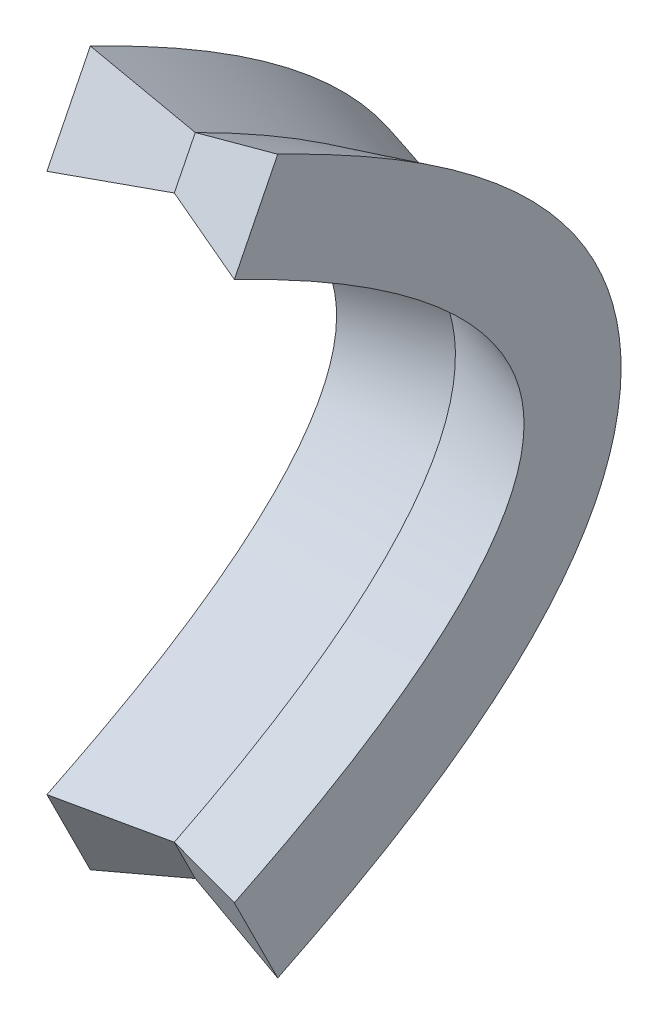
ISO-10303-21;
HEADER;
FILE_DESCRIPTION(('STEP AP214'),'2;1');
FILE_NAME('part.step','',(''),(''),'','','');
FILE_SCHEMA(('AUTOMOTIVE_DESIGN { 1 0 10303 214 1 1 1 1 }'));
ENDSEC;
DATA;
#1=APPLICATION_CONTEXT('core data for automotive mechanical design processes');
#2=APPLICATION_PROTOCOL_DEFINITION('international standard','automotive_design',2000,#1);
#3=PRODUCT_CONTEXT('',#1,'mechanical');
#4=PRODUCT('Part','Part','',(#3));
#5=PRODUCT_RELATED_PRODUCT_CATEGORY('part','',(#4));
#6=PRODUCT_DEFINITION_FORMATION('','',#4);
#7=PRODUCT_DEFINITION_CONTEXT('part definition',#1,'design');
#8=PRODUCT_DEFINITION('design','',#6,#7);
#9=PRODUCT_DEFINITION_SHAPE('','',#8);
#10=(LENGTH_UNIT() NAMED_UNIT(*) SI_UNIT(.MILLI.,.METRE.));
#11=(NAMED_UNIT(*) PLANE_ANGLE_UNIT() SI_UNIT($,.RADIAN.));
#12=(NAMED_UNIT(*) SI_UNIT($,.STERADIAN.) SOLID_ANGLE_UNIT());
#13=UNCERTAINTY_MEASURE_WITH_UNIT(LENGTH_MEASURE(1.E-05),#10,'distance_accuracy_value','');
#14=(GEOMETRIC_REPRESENTATION_CONTEXT(3) GLOBAL_UNCERTAINTY_ASSIGNED_CONTEXT((#13)) GLOBAL_UNIT_ASSIGNED_CONTEXT((#10,
#11,#12)) REPRESENTATION_CONTEXT('',''));
#15=CARTESIAN_POINT('',(0.,0.,0.));
#16=DIRECTION('',(0.,0.,1.));
#17=DIRECTION('',(1.,0.,0.));
#18=AXIS2_PLACEMENT_3D('',#15,#16,#17);
#19=CARTESIAN_POINT('',(-24.,77.8841113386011,44.0278802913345));
#20=CARTESIAN_POINT('',(-24.,76.8214532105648,41.9025640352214));
#21=CARTESIAN_POINT('',(-24.,75.7587950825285,39.7772477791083));
#22=CARTESIAN_POINT('',(-24.,74.6961369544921,37.6519315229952));
#23=CARTESIAN_POINT('',(-24.,69.4515509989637,27.1627596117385));
#24=CARTESIAN_POINT('',(-24.,64.1379632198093,17.835933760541));
#25=CARTESIAN_POINT('',(-24.,55.937872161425,5.53579726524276));
#26=CARTESIAN_POINT('',(-24.,53.1637099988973,1.71505510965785));
#27=CARTESIAN_POINT('',(-24.,47.4968581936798,-5.36850967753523));
#28=CARTESIAN_POINT('',(-24.,44.601740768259,-8.63489201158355));
#29=CARTESIAN_POINT('',(-24.,38.6348920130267,-14.6017407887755));
#30=CARTESIAN_POINT('',(-24.,35.5587137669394,-17.3069404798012));
#31=CARTESIAN_POINT('',(-24.,29.1582229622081,-22.1073085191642));
#32=CARTESIAN_POINT('',(-24.,25.8281155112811,-24.2061135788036));
#33=CARTESIAN_POINT('',(-24.,18.8680214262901,-27.6861603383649));
#34=CARTESIAN_POINT('',(-24.,15.2386177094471,-29.0643067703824));
#35=CARTESIAN_POINT('',(-24.,7.73148156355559,-30.9410904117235));
#36=CARTESIAN_POINT('',(-24.,3.87461153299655,-31.430780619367));
#37=CARTESIAN_POINT('',(-24.,-3.87461155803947,-31.4307806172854));
#38=CARTESIAN_POINT('',(-24.,-7.73148158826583,-30.9410904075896));
#39=CARTESIAN_POINT('',(-24.,-15.2386177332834,-29.0643067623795));
#40=CARTESIAN_POINT('',(-24.,-18.868021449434,-27.6861603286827));
#41=CARTESIAN_POINT('',(-24.,-25.8281155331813,-24.2061135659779));
#42=CARTESIAN_POINT('',(-24.,-29.1582229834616,-22.1073085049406));
#43=CARTESIAN_POINT('',(-24.,-35.5587137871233,-17.3069404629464));
#44=CARTESIAN_POINT('',(-24.,-38.6348920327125,-14.6017407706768));
#45=CARTESIAN_POINT('',(-24.,-44.601740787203,-8.63489199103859));
#46=CARTESIAN_POINT('',(-24.,-47.4968582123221,-5.36850965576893));
#47=CARTESIAN_POINT('',(-24.,-53.1637100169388,1.71505513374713));
#48=CARTESIAN_POINT('',(-24.,-55.9378721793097,5.53579729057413));
#49=CARTESIAN_POINT('',(-24.,-64.1379632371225,17.8359337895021));
#50=CARTESIAN_POINT('',(-24.,-69.451551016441,27.1627596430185));
#51=CARTESIAN_POINT('',(-24.,-74.6961369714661,37.6519315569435));
#52=CARTESIAN_POINT('',(-24.,-75.7587950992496,39.7772478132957));
#53=CARTESIAN_POINT('',(-24.,-76.8214532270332,41.9025640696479));
#54=CARTESIAN_POINT('',(-24.,-77.8841113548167,44.0278803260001));
#55=CARTESIAN_POINT('',(0.,72.0741866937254,46.7876936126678));
#56=CARTESIAN_POINT('',(0.,71.0308817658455,44.7010837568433));
#57=CARTESIAN_POINT('',(0.,69.9875768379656,42.6144739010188));
#58=CARTESIAN_POINT('',(0.,68.9442719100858,40.5278640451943));
#59=CARTESIAN_POINT('',(0.,63.7952007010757,30.2297216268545));
#60=CARTESIAN_POINT('',(0.,58.6049646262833,21.1296905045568));
#61=CARTESIAN_POINT('',(0.,50.678272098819,9.23965179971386));
#62=CARTESIAN_POINT('',(0.,48.011840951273,5.56949060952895));
#63=CARTESIAN_POINT('',(0.,42.60553523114,-1.18839156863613));
#64=CARTESIAN_POINT('',(0.,39.8656956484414,-4.2764399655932));
#65=CARTESIAN_POINT('',(0.,34.2764399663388,-9.86569566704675));
#66=CARTESIAN_POINT('',(0.,31.4266667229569,-12.3674999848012));
#67=CARTESIAN_POINT('',(0.,25.5733332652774,-16.7575000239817));
#68=CARTESIAN_POINT('',(0.,22.5684208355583,-18.6461295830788));
#69=CARTESIAN_POINT('',(0.,16.375851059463,-21.7424142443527));
#70=CARTESIAN_POINT('',(0.,13.1862522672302,-22.9487011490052));
#71=CARTESIAN_POINT('',(0.,6.66446021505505,-24.5791488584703));
#72=CARTESIAN_POINT('',(0.,3.33333310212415,-25.0000000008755));
#73=CARTESIAN_POINT('',(0.,-3.33333312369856,-24.999999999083));
#74=CARTESIAN_POINT('',(0.,-6.66446023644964,-24.5791488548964));
#75=CARTESIAN_POINT('',(0.,-13.186252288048,-22.948701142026));
#76=CARTESIAN_POINT('',(0.,-16.3758510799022,-21.7424142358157));
#77=CARTESIAN_POINT('',(0.,-22.5684208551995,-18.6461295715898));
#78=CARTESIAN_POINT('',(0.,-25.5733332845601,-16.7575000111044));
#79=CARTESIAN_POINT('',(0.,-31.4266667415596,-12.367499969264));
#80=CARTESIAN_POINT('',(0.,-34.2764399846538,-9.86569565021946));
#81=CARTESIAN_POINT('',(0.,-39.8656956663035,-4.27643994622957));
#82=CARTESIAN_POINT('',(0.,-42.6055352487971,-1.18839154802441));
#83=CARTESIAN_POINT('',(0.,-48.0118409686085,5.56949063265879));
#84=CARTESIAN_POINT('',(0.,-50.6782721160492,9.23965182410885));
#85=CARTESIAN_POINT('',(0.,-58.6049646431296,21.1296905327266));
#86=CARTESIAN_POINT('',(0.,-63.7952007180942,30.2297216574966));
#87=CARTESIAN_POINT('',(0.,-68.9442719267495,40.5278640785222));
#88=CARTESIAN_POINT('',(0.,-69.9875768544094,42.6144739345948));
#89=CARTESIAN_POINT('',(0.,-71.0308817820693,44.7010837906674));
#90=CARTESIAN_POINT('',(0.,-72.0741867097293,46.7876936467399));
#91=B_SPLINE_SURFACE_WITH_KNOTS('',1,3,((#19,#20,#21,#22,#23,#24,#25,#26,#27,#28,#29,#30,#31,
#32,#33,#34,#35,#36,#37,#38,#39,#40,#41,#42,#43,#44,#45,#46,#47,#48,#49,#50,#51,#52,#53,#54),
(#55,#56,#57,#58,#59,#60,#61,#62,#63,#64,#65,#66,#67,#68,#69,#70,#71,#72,#73,#74,#75,#76,#77,
#78,#79,#80,#81,#82,#83,#84,#85,#86,#87,#88,#89,#90)),.UNSPECIFIED.,.F.,.F.,.F.,(2,2),(4,3,2,2,
2,2,2,2,2,2,2,2,2,2,2,3,4),(0.,1.),(-0.0253275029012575,0.,0.125,0.1875,0.25,0.3125,0.375,
0.4375,0.5,0.5625,0.625,0.6875,0.75,0.8125,0.875,1.,1.02532750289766),.UNSPECIFIED.);
#92=CARTESIAN_POINT('',(0.,68.9442719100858,40.5278640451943));
#93=CARTESIAN_POINT('',(0.,68.3309117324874,39.3011958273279));
#94=CARTESIAN_POINT('',(0.,67.7103165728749,38.0781244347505));
#95=CARTESIAN_POINT('',(0.,66.4517621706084,35.6365069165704));
#96=CARTESIAN_POINT('',(0.,65.8137582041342,34.4179838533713));
#97=CARTESIAN_POINT('',(0.,64.5196225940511,31.9872580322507));
#98=CARTESIAN_POINT('',(0.,63.8634552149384,30.7750742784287));
#99=CARTESIAN_POINT('',(0.,62.5321024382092,28.3589061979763));
#100=CARTESIAN_POINT('',(0.,61.856890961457,27.1549362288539));
#101=CARTESIAN_POINT('',(0.,60.4864492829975,24.7571316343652));
#102=CARTESIAN_POINT('',(0.,59.7912032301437,23.5633060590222));
#103=CARTESIAN_POINT('',(0.,58.379559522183,21.1878003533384));
#104=CARTESIAN_POINT('',(0.,57.6631565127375,20.0061234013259));
#105=CARTESIAN_POINT('',(0.,56.1944963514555,17.6353760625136));
#106=CARTESIAN_POINT('',(0.,55.4418239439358,16.44656257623));
#107=CARTESIAN_POINT('',(0.,53.9115751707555,14.0858543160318));
#108=CARTESIAN_POINT('',(0.,53.1340108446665,12.9139517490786));
#109=CARTESIAN_POINT('',(0.,51.5519864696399,10.5895887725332));
#110=CARTESIAN_POINT('',(0.,50.7475452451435,9.43711557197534));
#111=CARTESIAN_POINT('',(0.,49.1094059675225,7.15439811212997));
#112=CARTESIAN_POINT('',(0.,48.2757299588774,6.02413806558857));
#113=CARTESIAN_POINT('',(0.,46.5764725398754,3.78885952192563));
#114=CARTESIAN_POINT('',(0.,45.7109099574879,2.6838267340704));
#115=CARTESIAN_POINT('',(0.,43.944771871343,0.502257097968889));
#116=CARTESIAN_POINT('',(0.,43.044201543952,-0.574283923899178));
#117=CARTESIAN_POINT('',(0.,41.6013048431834,-2.23711979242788));
#118=CARTESIAN_POINT('',(0.,41.0719216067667,-2.83467335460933));
#119=CARTESIAN_POINT('',(0.,40.0001013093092,-4.018074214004));
#120=CARTESIAN_POINT('',(0.,39.4576630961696,-4.60392046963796));
#121=CARTESIAN_POINT('',(0.,38.3591807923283,-5.76275360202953));
#122=CARTESIAN_POINT('',(0.,37.8031363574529,-6.33574015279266));
#123=CARTESIAN_POINT('',(0.,36.6768571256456,-7.46768905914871));
#124=CARTESIAN_POINT('',(0.,36.1066213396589,-8.02665043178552));
#125=CARTESIAN_POINT('',(0.,34.9519915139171,-9.12848340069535));
#126=CARTESIAN_POINT('',(0.,34.3676137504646,-9.67137203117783));
#127=CARTESIAN_POINT('',(0.,33.1834679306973,-10.7401471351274));
#128=CARTESIAN_POINT('',(0.,32.5836995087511,-11.2660332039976));
#129=CARTESIAN_POINT('',(0.,31.3682574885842,-12.2990818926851));
#130=CARTESIAN_POINT('',(0.,30.7525844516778,-12.8062451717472));
#131=CARTESIAN_POINT('',(0.,29.5048335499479,-13.8001026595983));
#132=CARTESIAN_POINT('',(0.,28.8727540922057,-14.2867948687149));
#133=CARTESIAN_POINT('',(0.,27.3654764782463,-15.4057726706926));
#134=CARTESIAN_POINT('',(0.,26.4833040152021,-16.028724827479));
#135=CARTESIAN_POINT('',(0.,24.6876360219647,-17.2278500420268));
#136=CARTESIAN_POINT('',(0.,23.7741397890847,-17.8040220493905));
#137=CARTESIAN_POINT('',(0.,21.9155839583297,-18.903740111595));
#138=CARTESIAN_POINT('',(0.,20.9705189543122,-19.4272770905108));
#139=CARTESIAN_POINT('',(0.,19.5314866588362,-20.1676383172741));
#140=CARTESIAN_POINT('',(0.,19.0488587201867,-20.406661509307));
#141=CARTESIAN_POINT('',(0.,18.0762330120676,-20.8691788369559));
#142=CARTESIAN_POINT('',(0.,17.586235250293,-21.0926729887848));
#143=CARTESIAN_POINT('',(0.,16.1056192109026,-21.7387108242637));
#144=CARTESIAN_POINT('',(0.,15.1041569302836,-22.1369243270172));
#145=CARTESIAN_POINT('',(0.,13.5833205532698,-22.6806378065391));
#146=CARTESIAN_POINT('',(0.,13.073353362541,-22.852917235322));
#147=CARTESIAN_POINT('',(0.,12.0474943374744,-23.1789499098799));
#148=CARTESIAN_POINT('',(0.,11.5316024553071,-23.332703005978));
#149=CARTESIAN_POINT('',(0.,10.4592003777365,-23.6307526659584));
#150=CARTESIAN_POINT('',(0.,9.90231261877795,-23.7736962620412));
#151=CARTESIAN_POINT('',(0.,8.78320600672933,-24.0367042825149));
#152=CARTESIAN_POINT('',(0.,8.22098711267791,-24.1567685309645));
#153=CARTESIAN_POINT('',(0.,6.52770354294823,-24.4819008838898));
#154=CARTESIAN_POINT('',(0.,5.38960434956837,-24.6520224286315));
#155=CARTESIAN_POINT('',(0.,3.67520100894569,-24.8344721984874));
#156=CARTESIAN_POINT('',(0.,3.10248052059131,-24.883167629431));
#157=CARTESIAN_POINT('',(0.,1.95543217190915,-24.9559992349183));
#158=CARTESIAN_POINT('',(0.,1.38110432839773,-24.9801356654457));
#159=CARTESIAN_POINT('',(0.,0.231919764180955,-25.0034640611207));
#160=CARTESIAN_POINT('',(0.,-0.342936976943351,-25.0026550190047));
#161=CARTESIAN_POINT('',(0.,-1.49204115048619,-24.9761248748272));
#162=CARTESIAN_POINT('',(0.,-2.0662885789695,-24.9504036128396));
#163=CARTESIAN_POINT('',(0.,-3.78567895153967,-24.8364447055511));
#164=CARTESIAN_POINT('',(0.,-4.92859139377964,-24.711433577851));
#165=CARTESIAN_POINT('',(0.,-7.19974255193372,-24.366449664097));
#166=CARTESIAN_POINT('',(0.,-8.32798161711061,-24.1464791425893));
#167=CARTESIAN_POINT('',(0.,-10.563021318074,-23.6153615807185));
#168=CARTESIAN_POINT('',(0.,-11.669816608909,-23.3041921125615));
#169=CARTESIAN_POINT('',(0.,-13.8562486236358,-22.5978280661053));
#170=CARTESIAN_POINT('',(0.,-14.9358816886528,-22.2026222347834));
#171=CARTESIAN_POINT('',(0.,-16.9754994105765,-21.3715339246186));
#172=CARTESIAN_POINT('',(0.,-17.9379781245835,-20.9417486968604));
#173=CARTESIAN_POINT('',(0.,-19.3603562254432,-20.2530188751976));
#174=CARTESIAN_POINT('',(0.,-19.8310291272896,-20.0160419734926));
#175=CARTESIAN_POINT('',(0.,-20.7651263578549,-19.5282021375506));
#176=CARTESIAN_POINT('',(0.,-21.2285506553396,-19.2773391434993));
#177=CARTESIAN_POINT('',(0.,-22.6077724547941,-18.5049608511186));
#178=CARTESIAN_POINT('',(0.,-23.5125514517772,-17.9636403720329));
#179=CARTESIAN_POINT('',(0.,-25.2939954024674,-16.8328114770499));
#180=CARTESIAN_POINT('',(0.,-26.1705964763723,-16.2432030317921));
#181=CARTESIAN_POINT('',(0.,-27.8940056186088,-15.0222801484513));
#182=CARTESIAN_POINT('',(0.,-28.7408177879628,-14.3909714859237));
#183=CARTESIAN_POINT('',(0.,-30.405595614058,-13.091447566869));
#184=CARTESIAN_POINT('',(0.,-31.2235601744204,-12.4232309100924));
#185=CARTESIAN_POINT('',(0.,-32.8938526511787,-11.0010861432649));
#186=CARTESIAN_POINT('',(0.,-33.7439372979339,-10.2445276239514));
#187=CARTESIAN_POINT('',(0.,-35.4135851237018,-8.69808935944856));
#188=CARTESIAN_POINT('',(0.,-36.233139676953,-7.90820032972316));
#189=CARTESIAN_POINT('',(0.,-37.8437548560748,-6.29914477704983));
#190=CARTESIAN_POINT('',(0.,-38.6348007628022,-5.47996355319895));
#191=CARTESIAN_POINT('',(0.,-40.1898794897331,-3.8158570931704));
#192=CARTESIAN_POINT('',(0.,-40.953902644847,-2.97092284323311));
#193=CARTESIAN_POINT('',(0.,-42.4562899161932,-1.25873018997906));
#194=CARTESIAN_POINT('',(0.,-43.1946565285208,-0.391473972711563));
#195=CARTESIAN_POINT('',(0.,-44.6507967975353,1.36665610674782));
#196=CARTESIAN_POINT('',(0.,-45.3684639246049,2.25761805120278));
#197=CARTESIAN_POINT('',(0.,-46.7810518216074,4.05672885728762));
#198=CARTESIAN_POINT('',(0.,-47.4759825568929,4.96486990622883));
#199=CARTESIAN_POINT('',(0.,-48.8447332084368,6.79663999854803));
#200=CARTESIAN_POINT('',(0.,-49.5185570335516,7.72026612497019));
#201=CARTESIAN_POINT('',(0.,-50.8465764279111,9.58141498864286));
#202=CARTESIAN_POINT('',(0.,-51.5007732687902,10.5189368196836));
#203=CARTESIAN_POINT('',(0.,-52.7908606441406,12.4064056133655));
#204=CARTESIAN_POINT('',(0.,-53.4267521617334,13.3563519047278));
#205=CARTESIAN_POINT('',(0.,-54.6097500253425,15.1581417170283));
#206=CARTESIAN_POINT('',(0.,-55.1586936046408,16.0087808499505));
#207=CARTESIAN_POINT('',(0.,-56.243907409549,17.7180635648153));
#208=CARTESIAN_POINT('',(0.,-56.780178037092,18.5767068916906));
#209=CARTESIAN_POINT('',(0.,-57.8407592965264,20.3013822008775));
#210=CARTESIAN_POINT('',(0.,-58.3650695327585,21.1674144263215));
#211=CARTESIAN_POINT('',(0.,-59.4023765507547,22.9062952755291));
#212=CARTESIAN_POINT('',(0.,-59.9153726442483,23.7791443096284));
#213=CARTESIAN_POINT('',(0.,-60.9306424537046,25.5311192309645));
#214=CARTESIAN_POINT('',(0.,-61.4329155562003,26.410245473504));
#215=CARTESIAN_POINT('',(0.,-62.4206229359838,28.1624561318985));
#216=CARTESIAN_POINT('',(0.,-62.9061925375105,29.0354643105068));
#217=CARTESIAN_POINT('',(0.,-63.8678975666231,30.7866319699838));
#218=CARTESIAN_POINT('',(0.,-64.3440332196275,31.6647913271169));
#219=CARTESIAN_POINT('',(0.,-65.2873046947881,33.4258140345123));
#220=CARTESIAN_POINT('',(0.,-65.7544414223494,34.3086769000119));
#221=CARTESIAN_POINT('',(0.,-66.6801163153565,36.0786758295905));
#222=CARTESIAN_POINT('',(0.,-67.1386561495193,36.9658110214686));
#223=CARTESIAN_POINT('',(0.,-68.0475002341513,38.7439478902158));
#224=CARTESIAN_POINT('',(0.,-68.4978069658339,39.6349482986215));
#225=CARTESIAN_POINT('',(0.,-68.9442719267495,40.5278640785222));
#226=B_SPLINE_CURVE_WITH_KNOTS('',3,(#92,#93,#94,#95,#96,#97,#98,#99,#100,#101,#102,#103,#104,
#105,#106,#107,#108,#109,#110,#111,#112,#113,#114,#115,#116,#117,#118,#119,#120,#121,#122,#123,
#124,#125,#126,#127,#128,#129,#130,#131,#132,#133,#134,#135,#136,#137,#138,#139,#140,#141,#142,
#143,#144,#145,#146,#147,#148,#149,#150,#151,#152,#153,#154,#155,#156,#157,#158,#159,#160,#161,
#162,#163,#164,#165,#166,#167,#168,#169,#170,#171,#172,#173,#174,#175,#176,#177,#178,#179,#180,
#181,#182,#183,#184,#185,#186,#187,#188,#189,#190,#191,#192,#193,#194,#195,#196,#197,#198,#199,
#200,#201,#202,#203,#204,#205,#206,#207,#208,#209,#210,#211,#212,#213,#214,#215,#216,#217,#218,
#219,#220,#221,#222,#223,#224,#225),.UNSPECIFIED.,.F.,.F.,(4,2,2,2,2,2,2,2,2,2,2,2,2,2,2,2,2,2,
2,2,2,2,2,2,2,2,2,2,2,2,2,2,2,2,2,2,2,2,2,2,2,2,2,2,2,2,2,2,2,2,2,2,2,2,2,2,2,2,2,2,2,2,2,2,2,2,
4),(0.,4.11440907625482,8.24062670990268,12.3756380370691,16.5166167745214,20.660966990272,
24.8063751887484,29.0272347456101,33.246082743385,37.4620353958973,41.6748746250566,
45.8852649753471,50.0950351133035,52.4898362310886,54.8848494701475,57.2799233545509,
59.6751646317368,62.0677692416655,64.4604307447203,66.8530079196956,69.2458182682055,
72.4842766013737,75.722807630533,78.9618961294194,80.5773717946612,82.1928457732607,
85.4230477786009,87.037617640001,88.6522005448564,90.3765202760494,92.1008532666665,
95.5482531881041,97.2722140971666,98.9961570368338,100.720169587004,102.444193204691,
105.888886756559,109.333498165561,112.778957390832,116.224878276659,119.384835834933,
120.96552630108,122.546223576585,125.707509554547,128.875518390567,132.04308936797,
135.210780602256,138.623746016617,142.037668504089,145.453329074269,148.870199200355,
152.286735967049,155.718510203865,159.148759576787,162.578369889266,166.007757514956,
169.436960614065,172.47400510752,175.510953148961,178.548001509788,181.585234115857,
184.622640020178,187.619459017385,190.616206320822,193.612650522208,196.608506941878,
199.603445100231),.UNSPECIFIED.);
#227=CARTESIAN_POINT('',(0.,68.9442719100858,40.5278640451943));
#228=VERTEX_POINT('',#227);
#229=CARTESIAN_POINT('',(0.,-68.9442719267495,40.5278640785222));
#230=VERTEX_POINT('',#229);
#231=EDGE_CURVE('E93',#228,#230,#226,.T.);
#232=CARTESIAN_POINT('',(-20.,-76.1341032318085,42.9244745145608));
#233=CARTESIAN_POINT('',(-16.6666666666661,-74.9357980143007,42.5250394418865));
#234=CARTESIAN_POINT('',(-13.3333333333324,-73.7374927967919,42.1256043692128));
#235=CARTESIAN_POINT('',(-6.66666666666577,-71.3408823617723,41.3267342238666));
#236=CARTESIAN_POINT('',(-3.33333333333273,-70.1425771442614,40.9272991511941));
#237=CARTESIAN_POINT('',(0.,-68.9442719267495,40.5278640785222));
#238=B_SPLINE_CURVE_WITH_KNOTS('',3,(#232,#233,#234,#235,#236,#237),.UNSPECIFIED.,.F.,.F.,(4,2,
4),(0.,10.6938933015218,21.3877866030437),.UNSPECIFIED.);
#239=CARTESIAN_POINT('',(-20.,-76.1341032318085,42.9244745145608));
#240=VERTEX_POINT('',#239);
#241=EDGE_CURVE('E11',#240,#230,#238,.T.);
#242=CARTESIAN_POINT('',(-20.,76.1341032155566,42.9244744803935));
#243=CARTESIAN_POINT('',(-20.,75.981063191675,42.6183943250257));
#244=CARTESIAN_POINT('',(-20.,75.8280231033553,42.312314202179));
#245=CARTESIAN_POINT('',(-20.,75.521943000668,41.7001541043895));
#246=CARTESIAN_POINT('',(-20.,75.3689029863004,41.3940741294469));
#247=CARTESIAN_POINT('',(-20.,75.0628203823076,40.7819087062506));
#248=CARTESIAN_POINT('',(-20.,74.9097777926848,40.4758232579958));
#249=CARTESIAN_POINT('',(-20.,74.6036920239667,39.8636524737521));
#250=CARTESIAN_POINT('',(-20.,74.4506488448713,39.5575671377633));
#251=CARTESIAN_POINT('',(-20.,74.2209266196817,39.0981205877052));
#252=CARTESIAN_POINT('',(-20.,74.144246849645,38.9447597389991));
#253=CARTESIAN_POINT('',(-20.,73.9908846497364,38.6380393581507));
#254=CARTESIAN_POINT('',(-20.,73.9142022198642,38.4846798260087));
#255=CARTESIAN_POINT('',(-20.,73.7608475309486,38.1779557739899));
#256=CARTESIAN_POINT('',(-20.,73.6841752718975,38.024591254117));
#257=CARTESIAN_POINT('',(-20.,73.5305787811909,37.7179884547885));
#258=CARTESIAN_POINT('',(-20.,73.4536545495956,37.5647501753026));
#259=CARTESIAN_POINT('',(-20.,73.2225516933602,37.1052047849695));
#260=CARTESIAN_POINT('',(-20.,73.0680415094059,36.7990643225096));
#261=CARTESIAN_POINT('',(-20.,72.7580961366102,36.1872517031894));
#262=CARTESIAN_POINT('',(-20.,72.6026609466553,35.8815795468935));
#263=CARTESIAN_POINT('',(-20.,72.134528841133,34.9644447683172));
#264=CARTESIAN_POINT('',(-20.,71.8204253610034,34.3536992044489));
#265=CARTESIAN_POINT('',(-20.,71.1883366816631,33.1342151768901));
#266=CARTESIAN_POINT('',(-20.,70.8703514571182,32.5254767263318));
#267=CARTESIAN_POINT('',(-20.,70.2300790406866,31.309561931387));
#268=CARTESIAN_POINT('',(-20.,69.9077882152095,30.7023874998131));
#269=CARTESIAN_POINT('',(-20.,69.2590483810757,29.4902659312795));
#270=CARTESIAN_POINT('',(-20.,68.9325993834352,28.8853187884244));
#271=CARTESIAN_POINT('',(-20.,68.2752311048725,27.6774599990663));
#272=CARTESIAN_POINT('',(-20.,67.9443096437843,27.0745495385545));
#273=CARTESIAN_POINT('',(-20.,67.2780082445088,25.8711981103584));
#274=CARTESIAN_POINT('',(-20.,66.9426283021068,25.2707571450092));
#275=CARTESIAN_POINT('',(-20.,65.9294649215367,23.4731517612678));
#276=CARTESIAN_POINT('',(-20.,65.2447529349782,22.2798796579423));
#277=CARTESIAN_POINT('',(-20.,63.8421644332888,19.8820216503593));
#278=CARTESIAN_POINT('',(-20.,63.1239031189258,18.6776607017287));
#279=CARTESIAN_POINT('',(-20.,61.6655510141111,16.2827532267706));
#280=CARTESIAN_POINT('',(-20.,60.925467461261,15.0922022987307));
#281=CARTESIAN_POINT('',(-20.,59.4219729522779,12.7266448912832));
#282=CARTESIAN_POINT('',(-20.,58.6585724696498,11.5516317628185));
#283=CARTESIAN_POINT('',(-20.,57.1067171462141,9.21902309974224));
#284=CARTESIAN_POINT('',(-20.,56.3182740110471,8.06141978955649));
#285=CARTESIAN_POINT('',(-20.,54.7140794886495,5.76586352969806));
#286=CARTESIAN_POINT('',(-20.,53.8983376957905,4.62790388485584));
#287=CARTESIAN_POINT('',(-20.,52.2370877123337,2.37397762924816));
#288=CARTESIAN_POINT('',(-20.,51.3915814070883,1.25800963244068));
#289=CARTESIAN_POINT('',(-20.,49.8940456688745,-0.659953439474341));
#290=CARTESIAN_POINT('',(-20.,49.2493185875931,-1.46765443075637));
#291=CARTESIAN_POINT('',(-20.,47.9413094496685,-3.06801958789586));
#292=CARTESIAN_POINT('',(-20.,47.2780259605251,-3.86068258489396));
#293=CARTESIAN_POINT('',(-20.,45.9317774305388,-5.42919265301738));
#294=CARTESIAN_POINT('',(-20.,45.2488115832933,-6.20503903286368));
#295=CARTESIAN_POINT('',(-20.,43.8620096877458,-7.73809220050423));
#296=CARTESIAN_POINT('',(-20.,43.1581704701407,-8.49529612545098));
#297=CARTESIAN_POINT('',(-20.,41.7309185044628,-9.98651178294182));
#298=CARTESIAN_POINT('',(-20.,41.0075740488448,-10.7205887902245));
#299=CARTESIAN_POINT('',(-20.,39.5381829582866,-12.1657300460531));
#300=CARTESIAN_POINT('',(-20.,38.7921358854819,-12.8767938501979));
#301=CARTESIAN_POINT('',(-20.,37.2763263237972,-14.2729666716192));
#302=CARTESIAN_POINT('',(-20.,36.5065676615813,-14.9580798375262));
#303=CARTESIAN_POINT('',(-20.,34.942295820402,-16.299441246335));
#304=CARTESIAN_POINT('',(-20.,34.1477841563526,-16.9556912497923));
#305=CARTESIAN_POINT('',(-20.,32.9087686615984,-17.9383419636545));
#306=CARTESIAN_POINT('',(-20.,32.4733263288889,-18.2762091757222));
#307=CARTESIAN_POINT('',(-20.,31.5950975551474,-18.9422570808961));
#308=CARTESIAN_POINT('',(-20.,31.152311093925,-19.2704377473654));
#309=CARTESIAN_POINT('',(-20.,29.8128156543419,-20.2395543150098));
#310=CARTESIAN_POINT('',(-20.,28.9048911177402,-20.8651280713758));
#311=CARTESIAN_POINT('',(-20.,27.0589246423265,-22.0703493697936));
#312=CARTESIAN_POINT('',(-20.,26.1208799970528,-22.6499927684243));
#313=CARTESIAN_POINT('',(-20.,24.2161736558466,-23.7575787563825));
#314=CARTESIAN_POINT('',(-20.,23.249549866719,-24.2855861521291));
#315=CARTESIAN_POINT('',(-20.,21.7782902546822,-25.0355509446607));
#316=CARTESIAN_POINT('',(-20.,21.2842973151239,-25.27853988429));
#317=CARTESIAN_POINT('',(-20.,20.2893586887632,-25.7498090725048));
#318=CARTESIAN_POINT('',(-20.,19.7884130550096,-25.9780894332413));
#319=CARTESIAN_POINT('',(-20.,18.2757248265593,-26.6398687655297));
#320=CARTESIAN_POINT('',(-20.,17.2537888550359,-27.050481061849));
#321=CARTESIAN_POINT('',(-20.,15.5996839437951,-27.6544175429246));
#322=CARTESIAN_POINT('',(-20.,14.9751563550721,-27.8689490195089));
#323=CARTESIAN_POINT('',(-20.,13.7181283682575,-28.2731815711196));
#324=CARTESIAN_POINT('',(-20.,13.0856285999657,-28.4628845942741));
#325=CARTESIAN_POINT('',(-20.,11.8134821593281,-28.8164926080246));
#326=CARTESIAN_POINT('',(-20.,11.1738357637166,-28.9803985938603));
#327=CARTESIAN_POINT('',(-20.,9.88826182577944,-29.2814040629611));
#328=CARTESIAN_POINT('',(-20.,9.24233432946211,-29.4185037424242));
#329=CARTESIAN_POINT('',(-20.,7.94543669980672,-29.6653792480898));
#330=CARTESIAN_POINT('',(-20.,7.29446781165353,-29.775161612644));
#331=CARTESIAN_POINT('',(-20.,5.98843974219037,-29.9669464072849));
#332=CARTESIAN_POINT('',(-20.,5.33338052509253,-30.0489485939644));
#333=CARTESIAN_POINT('',(-20.,4.02032560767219,-30.1847170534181));
#334=CARTESIAN_POINT('',(-20.,3.36232984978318,-30.2384827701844));
#335=CARTESIAN_POINT('',(-20.,2.04462654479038,-30.317385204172));
#336=CARTESIAN_POINT('',(-20.,1.3849190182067,-30.3425222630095));
#337=CARTESIAN_POINT('',(-20.,0.0639601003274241,-30.3637760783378));
#338=CARTESIAN_POINT('',(-20.,-0.597292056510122,-30.3598455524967));
#339=CARTESIAN_POINT('',(-20.,-1.91898765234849,-30.322952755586));
#340=CARTESIAN_POINT('',(-20.,-2.57943108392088,-30.289990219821));
#341=CARTESIAN_POINT('',(-20.,-3.89824844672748,-30.1954464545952));
#342=CARTESIAN_POINT('',(-20.,-4.55662241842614,-30.1338657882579));
#343=CARTESIAN_POINT('',(-20.,-5.87011406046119,-29.9824946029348));
#344=CARTESIAN_POINT('',(-20.,-6.52523173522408,-29.8927041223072));
#345=CARTESIAN_POINT('',(-20.,-7.83117370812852,-29.6853713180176));
#346=CARTESIAN_POINT('',(-20.,-8.4819972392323,-29.5678241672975));
#347=CARTESIAN_POINT('',(-20.,-9.77812181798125,-29.3054691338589));
#348=CARTESIAN_POINT('',(-20.,-10.4234228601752,-29.1606612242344));
#349=CARTESIAN_POINT('',(-20.,-11.7075138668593,-28.8443763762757));
#350=CARTESIAN_POINT('',(-20.,-12.3463032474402,-28.6728970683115));
#351=CARTESIAN_POINT('',(-20.,-13.6164139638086,-28.3043649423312));
#352=CARTESIAN_POINT('',(-20.,-14.2477354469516,-28.1073126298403));
#353=CARTESIAN_POINT('',(-20.,-15.8999928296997,-27.5557741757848));
#354=CARTESIAN_POINT('',(-20.,-16.9141194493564,-27.1806951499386));
#355=CARTESIAN_POINT('',(-20.,-18.9176985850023,-26.3693171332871));
#356=CARTESIAN_POINT('',(-20.,-19.907145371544,-25.9330040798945));
#357=CARTESIAN_POINT('',(-20.,-21.8591159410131,-25.0038919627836));
#358=CARTESIAN_POINT('',(-20.,-22.8216392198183,-24.5110918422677));
#359=CARTESIAN_POINT('',(-20.,-24.7196373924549,-23.4734776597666));
#360=CARTESIAN_POINT('',(-20.,-25.6550785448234,-22.9286020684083));
#361=CARTESIAN_POINT('',(-20.,-27.4969703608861,-21.7921312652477));
#362=CARTESIAN_POINT('',(-20.,-28.4034231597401,-21.2005395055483));
#363=CARTESIAN_POINT('',(-20.,-30.1874535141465,-19.9753260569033));
#364=CARTESIAN_POINT('',(-20.,-31.0650292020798,-19.3417016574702));
#365=CARTESIAN_POINT('',(-20.,-32.9818356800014,-17.8933498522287));
#366=CARTESIAN_POINT('',(-20.,-34.01413896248,-17.069454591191));
#367=CARTESIAN_POINT('',(-20.,-36.0379812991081,-15.3724897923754));
#368=CARTESIAN_POINT('',(-20.,-37.0295052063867,-14.4994022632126));
#369=CARTESIAN_POINT('',(-20.,-38.9738208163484,-12.7103239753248));
#370=CARTESIAN_POINT('',(-20.,-39.926593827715,-11.794312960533));
#371=CARTESIAN_POINT('',(-20.,-41.795306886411,-9.92555284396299));
#372=CARTESIAN_POINT('',(-20.,-42.7112467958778,-8.97280360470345));
#373=CARTESIAN_POINT('',(-20.,-44.5140569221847,-7.02903689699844));
#374=CARTESIAN_POINT('',(-20.,-45.4007071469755,-6.0378158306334));
#375=CARTESIAN_POINT('',(-20.,-47.1408270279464,-4.02739118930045));
#376=CARTESIAN_POINT('',(-20.,-47.9943092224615,-3.00819844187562));
#377=CARTESIAN_POINT('',(-20.,-49.6708028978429,-0.945273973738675));
#378=CARTESIAN_POINT('',(-20.,-50.4938174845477,0.0984552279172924));
#379=CARTESIAN_POINT('',(-20.,-52.1114643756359,2.20751404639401));
#380=CARTESIAN_POINT('',(-20.,-52.9060989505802,3.27284192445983));
#381=CARTESIAN_POINT('',(-20.,-54.4260914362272,5.36356951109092));
#382=CARTESIAN_POINT('',(-20.,-55.1528569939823,6.3879477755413));
#383=CARTESIAN_POINT('',(-20.,-56.5844520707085,8.45188376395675));
#384=CARTESIAN_POINT('',(-20.,-57.2892818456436,9.49144131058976));
#385=CARTESIAN_POINT('',(-20.,-58.678713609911,11.5842222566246));
#386=CARTESIAN_POINT('',(-20.,-59.3633121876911,12.6374479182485));
#387=CARTESIAN_POINT('',(-20.,-60.7135928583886,14.7563111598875));
#388=CARTESIAN_POINT('',(-20.,-61.3792702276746,15.8219517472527));
#389=CARTESIAN_POINT('',(-20.,-62.6928668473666,17.9644831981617));
#390=CARTESIAN_POINT('',(-20.,-63.3407815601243,19.0413768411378));
#391=CARTESIAN_POINT('',(-20.,-64.6199108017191,21.2053180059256));
#392=CARTESIAN_POINT('',(-20.,-65.2511219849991,22.2923675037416));
#393=CARTESIAN_POINT('',(-20.,-66.4831393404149,24.4499064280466));
#394=CARTESIAN_POINT('',(-20.,-67.0843113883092,25.5201871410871));
#395=CARTESIAN_POINT('',(-20.,-68.2724428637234,27.6684976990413));
#396=CARTESIAN_POINT('',(-20.,-68.8594033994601,28.7465269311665));
#397=CARTESIAN_POINT('',(-20.,-69.7297647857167,30.3687713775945));
#398=CARTESIAN_POINT('',(-20.,-70.0181660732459,30.9103108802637));
#399=CARTESIAN_POINT('',(-20.,-70.5917389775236,31.9950992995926));
#400=CARTESIAN_POINT('',(-20.,-70.8769105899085,32.5383482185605));
#401=CARTESIAN_POINT('',(-20.,-71.4439741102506,33.6261994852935));
#402=CARTESIAN_POINT('',(-20.,-71.7258676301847,34.1708009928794));
#403=CARTESIAN_POINT('',(-20.,-72.1464286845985,34.9888728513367));
#404=CARTESIAN_POINT('',(-20.,-72.2862356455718,35.2617580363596));
#405=CARTESIAN_POINT('',(-20.,-72.5651014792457,35.8079102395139));
#406=CARTESIAN_POINT('',(-20.,-72.7041603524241,36.0811772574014));
#407=CARTESIAN_POINT('',(-20.,-72.9814295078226,36.6278662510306));
#408=CARTESIAN_POINT('',(-20.,-73.1196403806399,36.9012879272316));
#409=CARTESIAN_POINT('',(-20.,-73.3264142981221,37.3116937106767));
#410=CARTESIAN_POINT('',(-20.,-73.3952485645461,37.4485412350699));
#411=CARTESIAN_POINT('',(-20.,-73.5327348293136,37.7223278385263));
#412=CARTESIAN_POINT('',(-20.,-73.6013868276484,37.8592669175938));
#413=CARTESIAN_POINT('',(-20.,-73.7385217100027,38.1332305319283));
#414=CARTESIAN_POINT('',(-20.,-73.8070045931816,38.2702550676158));
#415=CARTESIAN_POINT('',(-20.,-73.9439996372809,38.5442894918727));
#416=CARTESIAN_POINT('',(-20.,-74.012511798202,38.6812993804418));
#417=CARTESIAN_POINT('',(-20.,-74.2180402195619,39.0923330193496));
#418=CARTESIAN_POINT('',(-20.,-74.3550484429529,39.366360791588));
#419=CARTESIAN_POINT('',(-20.,-74.628895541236,39.9140632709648));
#420=CARTESIAN_POINT('',(-20.,-74.7657344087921,40.1877379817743));
#421=CARTESIAN_POINT('',(-20.,-75.0394106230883,40.7350881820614));
#422=CARTESIAN_POINT('',(-20.,-75.1762479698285,41.008763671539));
#423=CARTESIAN_POINT('',(-20.,-75.4499216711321,41.5561117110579));
#424=CARTESIAN_POINT('',(-20.,-75.5867580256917,41.8297842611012));
#425=CARTESIAN_POINT('',(-20.,-75.8604307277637,42.3771293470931));
#426=CARTESIAN_POINT('',(-20.,-75.9972670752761,42.6508018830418));
#427=CARTESIAN_POINT('',(-20.,-76.1341032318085,42.9244745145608));
#428=B_SPLINE_CURVE_WITH_KNOTS('',3,(#242,#243,#244,#245,#246,#247,#248,#249,#250,#251,#252,
#253,#254,#255,#256,#257,#258,#259,#260,#261,#262,#263,#264,#265,#266,#267,#268,#269,#270,#271,
#272,#273,#274,#275,#276,#277,#278,#279,#280,#281,#282,#283,#284,#285,#286,#287,#288,#289,#290,
#291,#292,#293,#294,#295,#296,#297,#298,#299,#300,#301,#302,#303,#304,#305,#306,#307,#308,#309,
#310,#311,#312,#313,#314,#315,#316,#317,#318,#319,#320,#321,#322,#323,#324,#325,#326,#327,#328,
#329,#330,#331,#332,#333,#334,#335,#336,#337,#338,#339,#340,#341,#342,#343,#344,#345,#346,#347,
#348,#349,#350,#351,#352,#353,#354,#355,#356,#357,#358,#359,#360,#361,#362,#363,#364,#365,#366,
#367,#368,#369,#370,#371,#372,#373,#374,#375,#376,#377,#378,#379,#380,#381,#382,#383,#384,#385,
#386,#387,#388,#389,#390,#391,#392,#393,#394,#395,#396,#397,#398,#399,#400,#401,#402,#403,#404,
#405,#406,#407,#408,#409,#410,#411,#412,#413,#414,#415,#416,#417,#418,#419,#420,#421,#422,#423,
#424,#425,#426,#427),.UNSPECIFIED.,.F.,.F.,(4,2,2,2,2,2,2,2,2,2,2,2,2,2,2,2,2,2,2,2,2,2,2,2,2,2,
2,2,2,2,2,2,2,2,2,2,2,2,2,2,2,2,2,2,2,2,2,2,2,2,2,2,2,2,2,2,2,2,2,2,2,2,2,2,2,2,2,2,2,2,2,2,2,2,
2,2,2,2,2,2,2,2,2,2,2,2,2,2,2,2,2,2,4),(0.,1.02662397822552,2.05324746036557,3.07988908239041,
4.1065312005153,4.6209182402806,5.13530534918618,5.64969206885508,6.16407866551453,
7.19284247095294,8.22160751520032,10.2819425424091,12.3422910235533,14.4045045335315,
16.4667125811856,18.5299649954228,20.5932193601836,24.7203248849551,28.9269444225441,
33.1321841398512,37.3355619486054,41.537003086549,45.736982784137,49.9366969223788,
53.0368545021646,56.1372520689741,59.2377768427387,62.3387748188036,65.430049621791,
68.5213840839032,71.6122222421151,74.7028716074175,76.356195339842,78.0095236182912,
81.315875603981,84.6225255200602,87.9249706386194,89.5763180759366,91.2276529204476,
94.529171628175,96.5097864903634,98.4902458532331,100.470628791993,102.450997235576,
104.43089122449,106.410802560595,108.390752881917,110.370679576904,112.353827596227,
114.336993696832,116.320120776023,118.303245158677,120.286714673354,122.270186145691,
124.25383394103,126.237442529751,129.478955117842,132.721213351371,135.963532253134,
139.209730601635,142.455689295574,145.701857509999,149.66242801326,153.624456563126,
157.588374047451,161.552306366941,165.541260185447,169.528691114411,173.515714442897,
177.5024180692,181.270117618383,185.037773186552,188.806060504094,192.57528044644,
196.345454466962,200.116377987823,203.798952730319,207.481239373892,209.321872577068,
211.162508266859,213.002196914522,213.922038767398,214.841880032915,215.760984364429,
216.220536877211,216.680089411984,217.139644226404,217.599199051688,218.518308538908,
219.436243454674,220.354178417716,221.272104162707,222.190029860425),.UNSPECIFIED.);
#429=CARTESIAN_POINT('',(-20.,76.1341032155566,42.9244744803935));
#430=VERTEX_POINT('',#429);
#431=EDGE_CURVE('E130',#430,#240,#428,.T.);
#432=CARTESIAN_POINT('',(-20.,76.1341032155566,42.9244744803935));
#433=CARTESIAN_POINT('',(-16.6666666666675,74.9357979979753,42.525039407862));
#434=CARTESIAN_POINT('',(-13.3333333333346,73.7374927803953,42.1256043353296));
#435=CARTESIAN_POINT('',(-6.66666666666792,71.3408823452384,41.3267341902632));
#436=CARTESIAN_POINT('',(-3.33333333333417,70.1425771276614,40.9272991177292));
#437=CARTESIAN_POINT('',(0.,68.9442719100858,40.5278640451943));
#438=B_SPLINE_CURVE_WITH_KNOTS('',3,(#432,#433,#434,#435,#436,#437),.UNSPECIFIED.,.F.,.F.,(4,2,
4),(0.,10.693893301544,21.3877866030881),.UNSPECIFIED.);
#439=EDGE_CURVE('E53',#430,#228,#438,.T.);
#440=ORIENTED_EDGE('',*,*,#231,.T.);
#441=ORIENTED_EDGE('',*,*,#241,.F.);
#442=ORIENTED_EDGE('',*,*,#431,.F.);
#443=ORIENTED_EDGE('',*,*,#439,.T.);
#444=EDGE_LOOP('',(#440,#441,#442,#443));
#445=FACE_BOUND('',#444,.T.);
#446=ADVANCED_FACE('F33',(#445),#91,.T.);
#447=CARTESIAN_POINT('',(0.,-60.0000000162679,45.0000000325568));
#448=DIRECTION('',(0.258819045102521,-0.431975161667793,0.863950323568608));
#449=DIRECTION('',(0.,-0.894427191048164,-0.447213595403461));
#450=AXIS2_PLACEMENT_3D('',#447,#448,#449);
#451=PLANE('',#450);
#452=DIRECTION('',(0.,-0.894427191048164,-0.447213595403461));
#453=VECTOR('',#452,1.);
#454=CARTESIAN_POINT('',(0.,-60.0000000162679,45.0000000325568));
#455=LINE('',#454,#453);
#456=CARTESIAN_POINT('',(0.,-60.0000000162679,45.0000000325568));
#457=VERTEX_POINT('',#456);
#458=EDGE_CURVE('E97',#457,#230,#455,.T.);
#459=ORIENTED_EDGE('',*,*,#458,.F.);
#460=CARTESIAN_POINT('',(-20.0000000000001,-57.6033895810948,52.1898313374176));
#461=CARTESIAN_POINT('',(-16.666666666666,-58.0028246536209,50.9915261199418));
#462=CARTESIAN_POINT('',(-13.3333333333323,-58.4022597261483,49.7932209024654));
#463=CARTESIAN_POINT('',(-6.66666666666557,-59.2011298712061,47.3966104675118));
#464=CARTESIAN_POINT('',(-3.33333333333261,-59.6005649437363,46.1983052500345));
#465=CARTESIAN_POINT('',(0.,-60.0000000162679,45.0000000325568));
#466=B_SPLINE_CURVE_WITH_KNOTS('',3,(#460,#461,#462,#463,#464,#465),.UNSPECIFIED.,.F.,.F.,(4,2,
4),(0.,10.6938933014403,21.3877866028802),.UNSPECIFIED.);
#467=CARTESIAN_POINT('',(-20.0000000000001,-57.6033895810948,52.1898313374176));
#468=VERTEX_POINT('',#467);
#469=EDGE_CURVE('E45',#468,#457,#466,.T.);
#470=ORIENTED_EDGE('',*,*,#469,.F.);
#471=DIRECTION('',(0.,-0.894427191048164,-0.447213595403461));
#472=VECTOR('',#471,1.);
#473=CARTESIAN_POINT('',(-20.,-42.3966104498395,59.7932209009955));
#474=LINE('',#473,#472);
#475=EDGE_CURVE('E106',#468,#240,#474,.T.);
#476=ORIENTED_EDGE('',*,*,#475,.T.);
#477=ORIENTED_EDGE('',*,*,#241,.T.);
#478=EDGE_LOOP('',(#459,#470,#476,#477));
#479=FACE_BOUND('',#478,.T.);
#480=ADVANCED_FACE('F102',(#479),#451,.T.);
#481=CARTESIAN_POINT('',(-24.,57.3717784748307,54.1232195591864));
#482=CARTESIAN_POINT('',(-24.,56.3305639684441,52.0407905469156));
#483=CARTESIAN_POINT('',(-24.,55.2893494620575,49.9583615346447));
#484=CARTESIAN_POINT('',(-24.,54.2481349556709,47.8759325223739));
#485=CARTESIAN_POINT('',(-24.,49.3442002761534,38.0680631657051));
#486=CARTESIAN_POINT('',(-24.,44.4663360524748,29.5427587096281));
#487=CARTESIAN_POINT('',(-24.,34.8321981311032,15.0915518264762));
#488=CARTESIAN_POINT('',(-24.,30.0738140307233,9.16831119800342));
#489=CARTESIAN_POINT('',(-24.,23.1422201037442,2.23671727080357));
#490=CARTESIAN_POINT('',(-24.,20.8671516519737,0.251339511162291));
#491=CARTESIAN_POINT('',(-24.,16.4159115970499,-3.08709052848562));
#492=CARTESIAN_POINT('',(-24.,14.240609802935,-4.43986379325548));
#493=CARTESIAN_POINT('',(-24.,10.0075251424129,-6.55640612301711));
#494=CARTESIAN_POINT('',(-24.,7.95099102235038,-7.32105530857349));
#495=CARTESIAN_POINT('',(-24.,3.92962217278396,-8.32639752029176));
#496=CARTESIAN_POINT('',(-24.,1.96410160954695,-8.56921939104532));
#497=CARTESIAN_POINT('',(-24.,-1.96410162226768,-8.56921937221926));
#498=CARTESIAN_POINT('',(-24.,-3.92962218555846,-8.32639751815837));
#499=CARTESIAN_POINT('',(-24.,-7.95099103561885,-7.32105530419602));
#500=CARTESIAN_POINT('',(-24.,-10.0075251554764,-6.55640611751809));
#501=CARTESIAN_POINT('',(-24.,-14.2406098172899,-4.43986378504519));
#502=CARTESIAN_POINT('',(-24.,-16.4159116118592,-3.08709051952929));
#503=CARTESIAN_POINT('',(-24.,-20.8671516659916,0.251339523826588));
#504=CARTESIAN_POINT('',(-24.,-23.142220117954,2.23671728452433));
#505=CARTESIAN_POINT('',(-24.,-30.0738140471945,9.16831121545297));
#506=CARTESIAN_POINT('',(-24.,-34.832198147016,15.0915518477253));
#507=CARTESIAN_POINT('',(-24.,-44.466336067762,29.5427587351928));
#508=CARTESIAN_POINT('',(-24.,-49.3442002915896,38.0680631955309));
#509=CARTESIAN_POINT('',(-24.,-54.2481349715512,47.8759325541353));
#510=CARTESIAN_POINT('',(-24.,-55.2893494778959,49.9583615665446));
#511=CARTESIAN_POINT('',(-24.,-56.3305639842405,52.0407905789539));
#512=CARTESIAN_POINT('',(-24.,-57.3717784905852,54.1232195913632));
#513=CARTESIAN_POINT('',(0.,63.184833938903,51.369667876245));
#514=CARTESIAN_POINT('',(0.,62.123222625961,49.2464452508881));
#515=CARTESIAN_POINT('',(0.,61.0616113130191,47.1232226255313));
#516=CARTESIAN_POINT('',(0.,60.0000000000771,45.0000000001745));
#517=CARTESIAN_POINT('',(0.,54.9999999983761,34.999999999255));
#518=CARTESIAN_POINT('',(0.,49.9999999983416,26.2499999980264));
#519=CARTESIAN_POINT('',(0.,39.999999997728,11.2499999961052));
#520=CARTESIAN_POINT('',(0.,34.9999999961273,4.99999999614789));
#521=CARTESIAN_POINT('',(0.,27.4999999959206,-2.50000000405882));
#522=CARTESIAN_POINT('',(0.,24.9999999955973,-4.68750000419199));
#523=CARTESIAN_POINT('',(0.,19.999999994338,-8.43750000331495));
#524=CARTESIAN_POINT('',(0.,17.4999999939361,-10.0000000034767));
#525=CARTESIAN_POINT('',(0.,12.4999999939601,-12.5000000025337));
#526=CARTESIAN_POINT('',(0.,9.9999999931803,-13.4375000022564));
#527=CARTESIAN_POINT('',(0.,4.99999999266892,-14.6875000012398));
#528=CARTESIAN_POINT('',(0.,2.49999999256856,-15.0000000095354));
#529=CARTESIAN_POINT('',(0.,-2.50000000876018,-14.9999999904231));
#530=CARTESIAN_POINT('',(0.,-5.00000000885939,-14.6874999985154));
#531=CARTESIAN_POINT('',(0.,-10.0000000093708,-13.4374999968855));
#532=CARTESIAN_POINT('',(0.,-12.5000000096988,-12.4999999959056));
#533=CARTESIAN_POINT('',(0.,-17.5000000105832,-9.99999999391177));
#534=CARTESIAN_POINT('',(0.,-20.0000000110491,-8.4374999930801));
#535=CARTESIAN_POINT('',(0.,-25.0000000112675,-4.68749999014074));
#536=CARTESIAN_POINT('',(0.,-27.5000000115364,-2.4999999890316));
#537=CARTESIAN_POINT('',(0.,-35.0000000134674,5.00000001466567));
#538=CARTESIAN_POINT('',(0.,-40.0000000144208,11.2500000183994));
#539=CARTESIAN_POINT('',(0.,-50.0000000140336,26.2500000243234));
#540=CARTESIAN_POINT('',(0.,-55.0000000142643,35.0000000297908));
#541=CARTESIAN_POINT('',(0.,-60.0000000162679,45.0000000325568));
#542=CARTESIAN_POINT('',(0.,-61.0616113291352,47.1232226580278));
#543=CARTESIAN_POINT('',(0.,-62.1232226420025,49.2464452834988));
#544=CARTESIAN_POINT('',(0.,-63.1848339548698,51.3696679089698));
#545=B_SPLINE_SURFACE_WITH_KNOTS('',1,3,((#481,#482,#483,#484,#485,#486,#487,#488,#489,#490,
#491,#492,#493,#494,#495,#496,#497,#498,#499,#500,#501,#502,#503,#504,#505,#506,#507,#508,#509,
#510,#511,#512),(#513,#514,#515,#516,#517,#518,#519,#520,#521,#522,#523,#524,#525,#526,#527,
#528,#529,#530,#531,#532,#533,#534,#535,#536,#537,#538,#539,#540,#541,#542,#543,#544)),
.UNSPECIFIED.,.F.,.F.,.F.,(2,2),(4,3,2,2,2,2,2,2,2,2,2,2,2,3,4),(0.,1.),(0.490880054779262,
0.491339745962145,0.493504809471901,0.495669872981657,0.496752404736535,0.497834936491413,
0.498917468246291,0.500000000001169,0.501082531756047,0.502165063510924,0.503247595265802,
0.50433012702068,0.506495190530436,0.508660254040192,0.509119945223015),.UNSPECIFIED.);
#546=CARTESIAN_POINT('',(0.,60.0000000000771,45.0000000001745));
#547=CARTESIAN_POINT('',(0.,59.3968057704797,43.7936734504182));
#548=CARTESIAN_POINT('',(0.,58.7863746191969,42.5909440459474));
#549=CARTESIAN_POINT('',(0.,57.5475112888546,40.1888309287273));
#550=CARTESIAN_POINT('',(0.,56.9190179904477,38.9894787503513));
#551=CARTESIAN_POINT('',(0.,55.6433351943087,36.5962158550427));
#552=CARTESIAN_POINT('',(0.,54.9960961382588,35.4023315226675));
#553=CARTESIAN_POINT('',(0.,53.6820704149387,33.0222008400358));
#554=CARTESIAN_POINT('',(0.,53.0152467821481,31.8359748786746));
#555=CARTESIAN_POINT('',(0.,51.6610578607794,29.4734313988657));
#556=CARTESIAN_POINT('',(0.,50.9736692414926,28.2971272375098));
#557=CARTESIAN_POINT('',(0.,49.5771716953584,25.9568028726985));
#558=CARTESIAN_POINT('',(0.,48.8680538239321,24.7927880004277));
#559=CARTESIAN_POINT('',(0.,47.3901858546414,22.4209401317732));
#560=CARTESIAN_POINT('',(0.,46.6202316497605,21.2138560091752));
#561=CARTESIAN_POINT('',(0.,45.0526833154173,18.8188384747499));
#562=CARTESIAN_POINT('',(0.,44.2551071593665,17.6308933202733));
#563=CARTESIAN_POINT('',(0.,42.6298600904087,15.277419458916));
#564=CARTESIAN_POINT('',(0.,41.8022189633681,14.1118702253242));
#565=CARTESIAN_POINT('',(0.,40.1138607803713,11.8068307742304));
#566=CARTESIAN_POINT('',(0.,39.2531801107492,10.6673139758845));
#567=CARTESIAN_POINT('',(0.,37.4950907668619,8.4184950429));
#568=CARTESIAN_POINT('',(0.,36.5977145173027,7.3091676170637));
#569=CARTESIAN_POINT('',(0.,34.761626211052,5.12546162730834));
#570=CARTESIAN_POINT('',(0.,33.8229227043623,4.05107591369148));
#571=CARTESIAN_POINT('',(0.,32.296557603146,2.37915308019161));
#572=CARTESIAN_POINT('',(0.,31.7239418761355,1.76784968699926));
#573=CARTESIAN_POINT('',(0.,30.5617377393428,0.561366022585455));
#574=CARTESIAN_POINT('',(0.,29.9721466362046,-0.0338116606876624));
#575=CARTESIAN_POINT('',(0.,28.7749690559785,-1.20599165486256));
#576=CARTESIAN_POINT('',(0.,28.1673799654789,-1.78299130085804));
#577=CARTESIAN_POINT('',(0.,26.9329857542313,-2.91658951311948));
#578=CARTESIAN_POINT('',(0.,26.3061732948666,-3.47318010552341));
#579=CARTESIAN_POINT('',(0.,25.0380544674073,-4.5582391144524));
#580=CARTESIAN_POINT('',(0.,24.3969219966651,-5.08691032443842));
#581=CARTESIAN_POINT('',(0.,23.0939850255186,-6.11820426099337));
#582=CARTESIAN_POINT('',(0.,22.4321805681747,-6.62082704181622));
#583=CARTESIAN_POINT('',(0.,21.0873732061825,-7.59624328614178));
#584=CARTESIAN_POINT('',(0.,20.4043806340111,-8.06905095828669));
#585=CARTESIAN_POINT('',(0.,19.016506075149,-8.98089646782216));
#586=CARTESIAN_POINT('',(0.,18.3116330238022,-9.41994784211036));
#587=CARTESIAN_POINT('',(0.,17.0391908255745,-10.1662585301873));
#588=CARTESIAN_POINT('',(0.,16.4760508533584,-10.4810755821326));
#589=CARTESIAN_POINT('',(0.,15.3363521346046,-11.0853495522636));
#590=CARTESIAN_POINT('',(0.,14.7597947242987,-11.3748089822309));
#591=CARTESIAN_POINT('',(0.,13.5935124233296,-11.9259407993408));
#592=CARTESIAN_POINT('',(0.,13.0037874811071,-12.1876130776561));
#593=CARTESIAN_POINT('',(0.,11.8120007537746,-12.6805257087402));
#594=CARTESIAN_POINT('',(0.,11.209944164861,-12.9117785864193));
#595=CARTESIAN_POINT('',(0.,9.9941536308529,-13.3414400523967));
#596=CARTESIAN_POINT('',(0.,9.3804191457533,-13.5398471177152));
#597=CARTESIAN_POINT('',(0.,8.14259854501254,-13.901351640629));
#598=CARTESIAN_POINT('',(0.,7.5185123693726,-14.0644488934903));
#599=CARTESIAN_POINT('',(0.,6.25506458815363,-14.354622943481));
#600=CARTESIAN_POINT('',(0.,5.61561133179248,-14.4813023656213));
#601=CARTESIAN_POINT('',(0.,4.3299751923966,-14.6944085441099));
#602=CARTESIAN_POINT('',(0.,3.68379199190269,-14.7808333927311));
#603=CARTESIAN_POINT('',(0.,2.38723044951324,-14.9120223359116));
#604=CARTESIAN_POINT('',(0.,1.73685235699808,-14.9567888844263));
#605=CARTESIAN_POINT('',(0.,0.43465949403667,-15.0039155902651));
#606=CARTESIAN_POINT('',(0.,-0.217155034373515,-15.0062824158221));
#607=CARTESIAN_POINT('',(0.,-1.51959853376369,-14.9685816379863));
#608=CARTESIAN_POINT('',(0.,-2.17022742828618,-14.9285113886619));
#609=CARTESIAN_POINT('',(0.,-3.4674303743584,-14.8066287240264));
#610=CARTESIAN_POINT('',(0.,-4.11400496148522,-14.7248219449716));
#611=CARTESIAN_POINT('',(0.,-5.60462097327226,-14.4884247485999));
#612=CARTESIAN_POINT('',(0.,-6.44633742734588,-14.3189876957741));
#613=CARTESIAN_POINT('',(0.,-8.11356567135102,-13.9144224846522));
#614=CARTESIAN_POINT('',(0.,-8.93907926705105,-13.6793016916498));
#615=CARTESIAN_POINT('',(0.,-10.570595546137,-13.1488032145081));
#616=CARTESIAN_POINT('',(0.,-11.3765942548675,-12.8534133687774));
#617=CARTESIAN_POINT('',(0.,-12.9665666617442,-12.2083409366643));
#618=CARTESIAN_POINT('',(0.,-13.7505370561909,-11.8586502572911));
#619=CARTESIAN_POINT('',(0.,-15.3763709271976,-11.0715986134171));
#620=CARTESIAN_POINT('',(0.,-16.2156346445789,-10.6288829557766));
#621=CARTESIAN_POINT('',(0.,-17.8652946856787,-9.69186918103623));
#622=CARTESIAN_POINT('',(0.,-18.6756747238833,-9.19754256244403));
#623=CARTESIAN_POINT('',(0.,-20.2675921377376,-8.16430715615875));
#624=CARTESIAN_POINT('',(0.,-21.0491239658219,-7.62538985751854));
#625=CARTESIAN_POINT('',(0.,-22.5866301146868,-6.50728491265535));
#626=CARTESIAN_POINT('',(0.,-23.3425125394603,-5.92797138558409));
#627=CARTESIAN_POINT('',(0.,-24.8271254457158,-4.73607841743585));
#628=CARTESIAN_POINT('',(0.,-25.5558636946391,-4.1235086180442));
#629=CARTESIAN_POINT('',(0.,-26.9878854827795,-2.86944490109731));
#630=CARTESIAN_POINT('',(0.,-27.6911702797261,-2.22795241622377));
#631=CARTESIAN_POINT('',(0.,-28.9124765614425,-1.07249137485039));
#632=CARTESIAN_POINT('',(0.,-29.4354242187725,-0.563707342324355));
#633=CARTESIAN_POINT('',(0.,-30.4680039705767,0.467213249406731));
#634=CARTESIAN_POINT('',(0.,-30.977635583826,0.989350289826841));
#635=CARTESIAN_POINT('',(0.,-32.488164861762,2.57442501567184));
#636=CARTESIAN_POINT('',(0.,-33.4701193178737,3.65547544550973));
#637=CARTESIAN_POINT('',(0.,-35.3894731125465,5.8582201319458));
#638=CARTESIAN_POINT('',(0.,-36.3268234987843,6.97995676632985));
#639=CARTESIAN_POINT('',(0.,-38.161179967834,9.25723206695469));
#640=CARTESIAN_POINT('',(0.,-39.0581557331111,10.4127950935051));
#641=CARTESIAN_POINT('',(0.,-40.8149848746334,12.7515264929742));
#642=CARTESIAN_POINT('',(0.,-41.6748422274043,13.9346918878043));
#643=CARTESIAN_POINT('',(0.,-43.3643398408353,16.3291620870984));
#644=CARTESIAN_POINT('',(0.,-44.1938514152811,17.5405574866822));
#645=CARTESIAN_POINT('',(0.,-45.8215954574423,19.9826148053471));
#646=CARTESIAN_POINT('',(0.,-46.619854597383,21.2132589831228));
#647=CARTESIAN_POINT('',(0.,-48.1882516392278,23.6915494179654));
#648=CARTESIAN_POINT('',(0.,-48.9584017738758,24.9391879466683));
#649=CARTESIAN_POINT('',(0.,-50.4732087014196,27.4495217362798));
#650=CARTESIAN_POINT('',(0.,-51.2178699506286,28.7122143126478));
#651=CARTESIAN_POINT('',(0.,-52.6839225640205,31.250973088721));
#652=CARTESIAN_POINT('',(0.,-53.4053146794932,32.5270388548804));
#653=CARTESIAN_POINT('',(0.,-54.4575851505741,34.425200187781));
#654=CARTESIAN_POINT('',(0.,-54.7966991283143,35.0427479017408));
#655=CARTESIAN_POINT('',(0.,-55.4701710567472,36.2804409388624));
#656=CARTESIAN_POINT('',(0.,-55.8045289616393,36.9005862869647));
#657=CARTESIAN_POINT('',(0.,-56.4686648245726,38.1433307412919));
#658=CARTESIAN_POINT('',(0.,-56.7984427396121,38.7659298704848));
#659=CARTESIAN_POINT('',(0.,-57.4516680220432,40.0098018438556));
#660=CARTESIAN_POINT('',(0.,-57.7751411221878,40.6310611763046));
#661=CARTESIAN_POINT('',(0.,-58.4178748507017,41.8757468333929));
#662=CARTESIAN_POINT('',(0.,-58.7371355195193,42.4991731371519));
#663=CARTESIAN_POINT('',(0.,-59.3715838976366,43.7480735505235));
#664=CARTESIAN_POINT('',(0.,-59.6867717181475,44.3735476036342));
#665=CARTESIAN_POINT('',(0.,-60.0000000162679,45.0000000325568));
#666=B_SPLINE_CURVE_WITH_KNOTS('',3,(#546,#547,#548,#549,#550,#551,#552,#553,#554,#555,#556,
#557,#558,#559,#560,#561,#562,#563,#564,#565,#566,#567,#568,#569,#570,#571,#572,#573,#574,#575,
#576,#577,#578,#579,#580,#581,#582,#583,#584,#585,#586,#587,#588,#589,#590,#591,#592,#593,#594,
#595,#596,#597,#598,#599,#600,#601,#602,#603,#604,#605,#606,#607,#608,#609,#610,#611,#612,#613,
#614,#615,#616,#617,#618,#619,#620,#621,#622,#623,#624,#625,#626,#627,#628,#629,#630,#631,#632,
#633,#634,#635,#636,#637,#638,#639,#640,#641,#642,#643,#644,#645,#646,#647,#648,#649,#650,#651,
#652,#653,#654,#655,#656,#657,#658,#659,#660,#661,#662,#663,#664,#665),.UNSPECIFIED.,.F.,.F.,(4,
2,2,2,2,2,2,2,2,2,2,2,2,2,2,2,2,2,2,2,2,2,2,2,2,2,2,2,2,2,2,2,2,2,2,2,2,2,2,2,2,2,2,2,2,2,2,2,2,
2,2,2,2,2,2,2,2,2,2,4),(0.,4.04618809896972,8.10821749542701,12.1821957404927,16.2644323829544,
20.3514903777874,24.4402539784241,28.735120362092,33.0272427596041,37.3152230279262,
41.5986093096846,45.8782892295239,50.1570878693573,52.6696258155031,55.1825646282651,
57.6958701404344,60.2101473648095,62.7025150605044,65.1948775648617,67.6860431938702,
70.1762045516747,72.1111258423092,74.0458552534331,75.9805922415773,77.9145301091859,
79.8485576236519,81.7825963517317,83.7370002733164,85.6914968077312,87.6458782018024,
89.5999522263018,91.5541480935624,93.5080801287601,96.0809330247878,98.6534975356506,
101.226581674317,103.800049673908,106.644579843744,109.490689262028,112.337343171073,
115.193302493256,118.048438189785,120.903432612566,123.092022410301,125.280691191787,
129.660420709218,134.044851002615,138.432520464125,142.819718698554,147.223760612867,
151.623958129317,156.022217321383,160.419703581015,164.817047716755,166.930623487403,
169.044219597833,171.157835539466,173.259099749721,175.360343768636,177.46153029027),.UNSPECIFIED.);
#667=CARTESIAN_POINT('',(0.,60.0000000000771,45.0000000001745));
#668=VERTEX_POINT('',#667);
#669=EDGE_CURVE('E121',#668,#457,#666,.T.);
#670=CARTESIAN_POINT('',(-20.,57.6033895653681,52.1898313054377));
#671=CARTESIAN_POINT('',(-16.6666666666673,58.0028246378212,50.9915260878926));
#672=CARTESIAN_POINT('',(-13.3333333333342,58.4022597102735,49.7932208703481));
#673=CARTESIAN_POINT('',(-6.66666666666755,59.2011298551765,47.3966104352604));
#674=CARTESIAN_POINT('',(-3.33333333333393,59.6005649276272,46.1983052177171));
#675=CARTESIAN_POINT('',(0.,60.0000000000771,45.0000000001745));
#676=B_SPLINE_CURVE_WITH_KNOTS('',3,(#670,#671,#672,#673,#674,#675),.UNSPECIFIED.,.F.,.F.,(4,2,
4),(0.,10.6938933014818,21.3877866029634),.UNSPECIFIED.);
#677=CARTESIAN_POINT('',(-20.,57.6033895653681,52.1898313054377));
#678=VERTEX_POINT('',#677);
#679=EDGE_CURVE('E61',#678,#668,#676,.T.);
#680=CARTESIAN_POINT('',(-20.,57.6033895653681,52.1898313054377));
#681=CARTESIAN_POINT('',(-20.,57.4529332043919,51.8889199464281));
#682=CARTESIAN_POINT('',(-20.,57.3024776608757,51.5880081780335));
#683=CARTESIAN_POINT('',(-20.,57.0015666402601,50.9861847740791));
#684=CARTESIAN_POINT('',(-20.,56.8511111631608,50.6852731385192));
#685=CARTESIAN_POINT('',(-20.,56.5501957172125,50.0834449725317));
#686=CARTESIAN_POINT('',(-20.,56.3997357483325,49.7825284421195));
#687=CARTESIAN_POINT('',(-20.,56.0988222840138,49.1806919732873));
#688=CARTESIAN_POINT('',(-20.,55.948368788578,48.8797720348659));
#689=CARTESIAN_POINT('',(-20.,55.6469096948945,48.2768893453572));
#690=CARTESIAN_POINT('',(-20.,55.4959040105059,47.9749266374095));
#691=CARTESIAN_POINT('',(-20.,55.2694645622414,47.5219480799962));
#692=CARTESIAN_POINT('',(-20.,55.1939962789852,47.3709495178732));
#693=CARTESIAN_POINT('',(-20.,55.0428278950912,47.0690684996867));
#694=CARTESIAN_POINT('',(-20.,54.9671277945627,46.9181860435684));
#695=CARTESIAN_POINT('',(-20.,54.8154928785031,46.6165409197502));
#696=CARTESIAN_POINT('',(-20.,54.7395580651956,46.4657782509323));
#697=CARTESIAN_POINT('',(-20.,54.5874514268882,46.1643724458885));
#698=CARTESIAN_POINT('',(-20.,54.511279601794,46.0137293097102));
#699=CARTESIAN_POINT('',(-20.,54.2824054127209,45.5619815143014));
#700=CARTESIAN_POINT('',(-20.,54.129344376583,45.2610585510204));
#701=CARTESIAN_POINT('',(-20.,53.6679512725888,44.3575642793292));
#702=CARTESIAN_POINT('',(-20.,53.3581502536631,43.7557421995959));
#703=CARTESIAN_POINT('',(-20.,52.7344974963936,42.5541952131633));
#704=CARTESIAN_POINT('',(-20.,52.4206457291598,41.9544703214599));
#705=CARTESIAN_POINT('',(-20.,51.7882166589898,40.7562319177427));
#706=CARTESIAN_POINT('',(-20.,51.4696323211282,40.1577221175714));
#707=CARTESIAN_POINT('',(-20.,50.8280968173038,38.9630493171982));
#708=CARTESIAN_POINT('',(-20.,50.5051456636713,38.3668863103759));
#709=CARTESIAN_POINT('',(-20.,49.8543885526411,37.1764541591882));
#710=CARTESIAN_POINT('',(-20.,49.5265781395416,36.5821874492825));
#711=CARTESIAN_POINT('',(-20.,48.8662338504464,35.3962851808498));
#712=CARTESIAN_POINT('',(-20.,48.5336999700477,34.8046496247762));
#713=CARTESIAN_POINT('',(-20.,47.5284966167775,33.0335114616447));
#714=CARTESIAN_POINT('',(-20.,46.8484466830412,31.8581827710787));
#715=CARTESIAN_POINT('',(-20.,45.4317236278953,29.4604268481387));
#716=CARTESIAN_POINT('',(-20.,44.6939323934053,28.2386595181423));
#717=CARTESIAN_POINT('',(-20.,43.1929150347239,25.8117544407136));
#718=CARTESIAN_POINT('',(-20.,42.4297031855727,24.606607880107));
#719=CARTESIAN_POINT('',(-20.,40.875445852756,22.2157671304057));
#720=CARTESIAN_POINT('',(-20.,40.0844236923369,21.0300578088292));
#721=CARTESIAN_POINT('',(-20.,38.4716072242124,18.6812787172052));
#722=CARTESIAN_POINT('',(-20.,37.64984136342,17.5181894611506));
#723=CARTESIAN_POINT('',(-20.,35.9722231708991,15.2181115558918));
#724=CARTESIAN_POINT('',(-20.,35.1163962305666,14.0811044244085));
#725=CARTESIAN_POINT('',(-20.,33.3663172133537,11.8372518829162));
#726=CARTESIAN_POINT('',(-20.,32.4720724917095,10.7304007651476));
#727=CARTESIAN_POINT('',(-20.,31.003717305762,8.98489470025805));
#728=CARTESIAN_POINT('',(-20.,30.4433254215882,8.33467958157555));
#729=CARTESIAN_POINT('',(-20.,29.3055264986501,7.04908975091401));
#730=CARTESIAN_POINT('',(-20.,28.7281167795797,6.41371740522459));
#731=CARTESIAN_POINT('',(-20.,27.5549453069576,5.15987462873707));
#732=CARTESIAN_POINT('',(-20.,26.9591798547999,4.54140765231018));
#733=CARTESIAN_POINT('',(-20.,25.7476817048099,3.32367950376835));
#734=CARTESIAN_POINT('',(-20.,25.1319390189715,2.72442824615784));
#735=CARTESIAN_POINT('',(-20.,23.8851479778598,1.5535973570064));
#736=CARTESIAN_POINT('',(-20.,23.2542899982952,0.981815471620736));
#737=CARTESIAN_POINT('',(-20.,21.9705213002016,-0.136462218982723));
#738=CARTESIAN_POINT('',(-20.,21.3176113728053,-0.682958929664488));
#739=CARTESIAN_POINT('',(-20.,19.9886318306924,-1.74623887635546));
#740=CARTESIAN_POINT('',(-20.,19.312577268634,-2.26304086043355));
#741=CARTESIAN_POINT('',(-20.,17.9358836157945,-3.26211549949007));
#742=CARTESIAN_POINT('',(-20.,17.2352583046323,-3.74440706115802));
#743=CARTESIAN_POINT('',(-20.,15.8247994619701,-4.65814522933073));
#744=CARTESIAN_POINT('',(-20.,15.1155707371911,-5.09052134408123));
#745=CARTESIAN_POINT('',(-20.,13.6717054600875,-5.91067974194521));
#746=CARTESIAN_POINT('',(-20.,12.9370709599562,-6.29846561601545));
#747=CARTESIAN_POINT('',(-20.,11.4426355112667,-7.02210365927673));
#748=CARTESIAN_POINT('',(-20.,10.6828380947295,-7.35796307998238));
#749=CARTESIAN_POINT('',(-20.,9.13910322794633,-7.96954128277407));
#750=CARTESIAN_POINT('',(-20.,8.35516530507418,-8.24525888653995));
#751=CARTESIAN_POINT('',(-20.,7.02382884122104,-8.64986968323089));
#752=CARTESIAN_POINT('',(-20.,6.4820509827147,-8.79739438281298));
#753=CARTESIAN_POINT('',(-20.,5.39037805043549,-9.0589145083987));
#754=CARTESIAN_POINT('',(-20.,4.84048278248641,-9.17290913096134));
#755=CARTESIAN_POINT('',(-20.,3.73446739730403,-9.36493511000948));
#756=CARTESIAN_POINT('',(-20.,3.17834770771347,-9.44296892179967));
#757=CARTESIAN_POINT('',(-20.,2.0627104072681,-9.56135721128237));
#758=CARTESIAN_POINT('',(-20.,1.50319760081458,-9.60175620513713));
#759=CARTESIAN_POINT('',(-20.,0.662901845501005,-9.63375230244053));
#760=CARTESIAN_POINT('',(-20.,0.382598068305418,-9.63964958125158));
#761=CARTESIAN_POINT('',(-20.,-0.178043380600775,-9.64196178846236));
#762=CARTESIAN_POINT('',(-20.,-0.458381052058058,-9.63837678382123));
#763=CARTESIAN_POINT('',(-20.,-1.29885120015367,-9.6133187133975));
#764=CARTESIAN_POINT('',(-20.,-1.85864201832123,-9.57755027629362));
#765=CARTESIAN_POINT('',(-20.,-2.77577045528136,-9.48782389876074));
#766=CARTESIAN_POINT('',(-20.,-3.13424446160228,-9.44487263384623));
#767=CARTESIAN_POINT('',(-20.,-3.84907318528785,-9.34374556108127));
#768=CARTESIAN_POINT('',(-20.,-4.20542779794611,-9.28556900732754));
#769=CARTESIAN_POINT('',(-20.,-4.91535350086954,-9.15450692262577));
#770=CARTESIAN_POINT('',(-20.,-5.26892500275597,-9.08162361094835));
#771=CARTESIAN_POINT('',(-20.,-5.97287074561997,-8.92181361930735));
#772=CARTESIAN_POINT('',(-20.,-6.32324500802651,-8.83488703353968));
#773=CARTESIAN_POINT('',(-20.,-7.02067547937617,-8.64746999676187));
#774=CARTESIAN_POINT('',(-20.,-7.36772849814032,-8.54696768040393));
#775=CARTESIAN_POINT('',(-20.,-8.0578201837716,-8.33309967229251));
#776=CARTESIAN_POINT('',(-20.,-8.40085889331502,-8.21973411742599));
#777=CARTESIAN_POINT('',(-20.,-9.42362195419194,-7.86130813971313));
#778=CARTESIAN_POINT('',(-20.,-10.0970067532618,-7.5979147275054));
#779=CARTESIAN_POINT('',(-20.,-11.2915495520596,-7.08522670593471));
#780=CARTESIAN_POINT('',(-20.,-11.8161078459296,-6.84373329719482));
#781=CARTESIAN_POINT('',(-20.,-12.8530569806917,-6.33587624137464));
#782=CARTESIAN_POINT('',(-20.,-13.3654475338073,-6.0695120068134));
#783=CARTESIAN_POINT('',(-20.,-14.3781896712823,-5.51423492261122));
#784=CARTESIAN_POINT('',(-20.,-14.8785343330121,-5.22530949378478));
#785=CARTESIAN_POINT('',(-20.,-15.8670227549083,-4.62737446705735));
#786=CARTESIAN_POINT('',(-20.,-16.3551669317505,-4.31836555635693));
#787=CARTESIAN_POINT('',(-20.,-17.3208095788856,-3.68145184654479));
#788=CARTESIAN_POINT('',(-20.,-17.7982762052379,-3.35349887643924));
#789=CARTESIAN_POINT('',(-20.,-18.7415765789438,-2.68126786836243));
#790=CARTESIAN_POINT('',(-20.,-19.2074099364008,-2.33698928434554));
#791=CARTESIAN_POINT('',(-20.,-20.1277062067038,-1.63382494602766));
#792=CARTESIAN_POINT('',(-20.,-20.5821720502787,-1.27494302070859));
#793=CARTESIAN_POINT('',(-20.,-21.4803334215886,-0.543969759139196));
#794=CARTESIAN_POINT('',(-20.,-21.9240289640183,-0.171878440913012));
#795=CARTESIAN_POINT('',(-20.,-22.8055622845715,0.588065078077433));
#796=CARTESIAN_POINT('',(-20.,-23.2432952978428,0.976038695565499));
#797=CARTESIAN_POINT('',(-20.,-24.1087342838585,1.7630211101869));
#798=CARTESIAN_POINT('',(-20.,-24.5364397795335,2.16203043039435));
#799=CARTESIAN_POINT('',(-20.,-25.8056834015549,3.37455298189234));
#800=CARTESIAN_POINT('',(-20.,-26.63288445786,4.20315760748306));
#801=CARTESIAN_POINT('',(-20.,-27.8477787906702,5.47145125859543));
#802=CARTESIAN_POINT('',(-20.,-28.2486354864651,5.89868488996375));
#803=CARTESIAN_POINT('',(-20.,-29.0420479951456,6.7608027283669));
#804=CARTESIAN_POINT('',(-20.,-29.4346038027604,7.19568694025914));
#805=CARTESIAN_POINT('',(-20.,-30.6009713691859,8.51143342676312));
#806=CARTESIAN_POINT('',(-20.,-31.3629397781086,9.40281918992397));
#807=CARTESIAN_POINT('',(-20.,-32.858113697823,11.2091436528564));
#808=CARTESIAN_POINT('',(-20.,-33.5913220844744,12.1240799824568));
#809=CARTESIAN_POINT('',(-20.,-35.0362895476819,13.9802371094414));
#810=CARTESIAN_POINT('',(-20.,-35.7478790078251,14.921589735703));
#811=CARTESIAN_POINT('',(-20.,-37.1462657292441,16.8212734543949));
#812=CARTESIAN_POINT('',(-20.,-37.8330833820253,17.7795895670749));
#813=CARTESIAN_POINT('',(-20.,-39.1842045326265,19.7113266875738));
#814=CARTESIAN_POINT('',(-20.,-39.8485175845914,20.684741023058));
#815=CARTESIAN_POINT('',(-20.,-41.1565640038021,22.6450237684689));
#816=CARTESIAN_POINT('',(-20.,-41.8003010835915,23.6318897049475));
#817=CARTESIAN_POINT('',(-20.,-43.0689668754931,25.6175436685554));
#818=CARTESIAN_POINT('',(-20.,-43.6938966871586,26.6163309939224));
#819=CARTESIAN_POINT('',(-20.,-44.8014074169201,28.4208942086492));
#820=CARTESIAN_POINT('',(-20.,-45.2871530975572,29.2247318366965));
#821=CARTESIAN_POINT('',(-20.,-46.2482806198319,30.8386235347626));
#822=CARTESIAN_POINT('',(-20.,-46.7236620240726,31.648677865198));
#823=CARTESIAN_POINT('',(-20.,-47.6646641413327,33.2745205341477));
#824=CARTESIAN_POINT('',(-20.,-48.1302840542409,34.0903093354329));
#825=CARTESIAN_POINT('',(-20.,-49.052300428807,35.7271789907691));
#826=CARTESIAN_POINT('',(-20.,-49.5086960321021,36.5482603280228));
#827=CARTESIAN_POINT('',(-20.,-50.4127449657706,38.1953071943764));
#828=CARTESIAN_POINT('',(-20.,-50.8603975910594,39.0212731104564));
#829=CARTESIAN_POINT('',(-20.,-51.5219674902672,40.2567373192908));
#830=CARTESIAN_POINT('',(-20.,-51.7390456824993,40.6645465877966));
#831=CARTESIAN_POINT('',(-20.,-52.1712362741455,41.481206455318));
#832=CARTESIAN_POINT('',(-20.,-52.3863486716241,41.8900570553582));
#833=CARTESIAN_POINT('',(-20.,-52.8146477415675,42.7087476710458));
#834=CARTESIAN_POINT('',(-20.,-53.027834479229,43.1185876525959));
#835=CARTESIAN_POINT('',(-20.,-53.4523353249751,43.9392353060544));
#836=CARTESIAN_POINT('',(-20.,-53.6636494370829,44.3500429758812));
#837=CARTESIAN_POINT('',(-20.,-53.9792375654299,44.9669337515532));
#838=CARTESIAN_POINT('',(-20.,-54.0841975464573,45.1726662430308));
#839=CARTESIAN_POINT('',(-20.,-54.2936663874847,45.5843607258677));
#840=CARTESIAN_POINT('',(-20.,-54.3981752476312,45.7903227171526));
#841=CARTESIAN_POINT('',(-20.,-54.6067445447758,46.2024741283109));
#842=CARTESIAN_POINT('',(-20.,-54.7108049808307,46.4086635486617));
#843=CARTESIAN_POINT('',(-20.,-54.9184927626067,46.8212605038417));
#844=CARTESIAN_POINT('',(-20.,-55.0221201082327,47.0276680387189));
#845=CARTESIAN_POINT('',(-20.,-55.1771989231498,47.3374305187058));
#846=CARTESIAN_POINT('',(-20.,-55.2288255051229,47.440697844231));
#847=CARTESIAN_POINT('',(-20.,-55.3320857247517,47.6472289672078));
#848=CARTESIAN_POINT('',(-20.,-55.3837193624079,47.750492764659));
#849=CARTESIAN_POINT('',(-20.,-55.5386183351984,48.0602851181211));
#850=CARTESIAN_POINT('',(-20.,-55.6418817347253,48.2668146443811));
#851=CARTESIAN_POINT('',(-20.,-55.8484098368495,48.6798728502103));
#852=CARTESIAN_POINT('',(-20.,-55.9516745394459,48.8864015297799));
#853=CARTESIAN_POINT('',(-20.,-56.1582035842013,49.2994590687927));
#854=CARTESIAN_POINT('',(-20.,-56.2614679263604,49.5059879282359));
#855=CARTESIAN_POINT('',(-20.,-56.5711750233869,50.125402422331));
#856=CARTESIAN_POINT('',(-20.,-56.7776178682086,50.538288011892));
#857=CARTESIAN_POINT('',(-20.,-57.1905037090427,51.3640594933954));
#858=CARTESIAN_POINT('',(-20.,-57.3969467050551,51.7769453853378));
#859=CARTESIAN_POINT('',(-20.,-57.603389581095,52.189831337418));
#860=B_SPLINE_CURVE_WITH_KNOTS('',3,(#680,#681,#682,#683,#684,#685,#686,#687,#688,#689,#690,
#691,#692,#693,#694,#695,#696,#697,#698,#699,#700,#701,#702,#703,#704,#705,#706,#707,#708,#709,
#710,#711,#712,#713,#714,#715,#716,#717,#718,#719,#720,#721,#722,#723,#724,#725,#726,#727,#728,
#729,#730,#731,#732,#733,#734,#735,#736,#737,#738,#739,#740,#741,#742,#743,#744,#745,#746,#747,
#748,#749,#750,#751,#752,#753,#754,#755,#756,#757,#758,#759,#760,#761,#762,#763,#764,#765,#766,
#767,#768,#769,#770,#771,#772,#773,#774,#775,#776,#777,#778,#779,#780,#781,#782,#783,#784,#785,
#786,#787,#788,#789,#790,#791,#792,#793,#794,#795,#796,#797,#798,#799,#800,#801,#802,#803,#804,
#805,#806,#807,#808,#809,#810,#811,#812,#813,#814,#815,#816,#817,#818,#819,#820,#821,#822,#823,
#824,#825,#826,#827,#828,#829,#830,#831,#832,#833,#834,#835,#836,#837,#838,#839,#840,#841,#842,
#843,#844,#845,#846,#847,#848,#849,#850,#851,#852,#853,#854,#855,#856,#857,#858,#859),
.UNSPECIFIED.,.F.,.F.,(4,2,2,2,2,2,2,2,2,2,2,2,2,2,2,2,2,2,2,2,2,2,2,2,2,2,2,2,2,2,2,2,2,2,2,2,
2,2,2,2,2,2,2,2,2,2,2,2,2,2,2,2,2,2,2,2,2,2,2,2,2,2,2,2,2,2,2,2,2,2,2,2,2,2,2,2,2,2,2,2,2,2,2,2,
2,2,2,2,2,4),(0.,1.00928829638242,2.01857614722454,3.02788316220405,4.03719062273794,
5.05003701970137,5.55645995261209,6.06288264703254,6.56930055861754,7.07571867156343,
8.08855517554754,10.1191791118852,12.1498175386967,14.1838573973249,16.2178915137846,
18.2539229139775,20.2899562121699,24.3634082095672,28.6448800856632,32.9239869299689,
37.1995868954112,41.471324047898,45.7399343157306,50.0077309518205,52.5826269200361,
55.1579306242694,57.7337566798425,60.3108910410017,62.8645633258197,65.4181440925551,
67.9700945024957,70.5206359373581,73.0111493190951,75.5014619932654,77.9914265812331,
80.4814399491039,82.1650122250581,83.8486248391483,85.5321224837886,87.2136262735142,
88.0545824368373,88.8955326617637,90.5768302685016,91.6596605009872,92.7425437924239,
93.8252637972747,94.907976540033,95.9916417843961,97.0752954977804,99.2425610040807,
100.974354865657,102.70618964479,104.438997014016,106.171745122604,107.909111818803,
109.64653666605,111.383508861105,113.120478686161,114.875031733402,116.629668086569,
120.140783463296,121.898243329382,123.655704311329,127.172988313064,130.689919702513,
134.229622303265,137.766341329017,141.30153955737,144.836096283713,148.370445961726,
151.18797928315,154.005631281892,156.823513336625,159.641656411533,162.460025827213,
163.845980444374,165.231936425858,166.617845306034,168.003751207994,168.696630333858,
169.389509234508,170.082389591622,170.775270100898,171.121629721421,171.467989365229,
172.160708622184,172.853427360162,173.546146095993,174.931006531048,176.315867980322),.UNSPECIFIED.);
#861=EDGE_CURVE('E182',#678,#468,#860,.T.);
#862=ORIENTED_EDGE('',*,*,#669,.F.);
#863=ORIENTED_EDGE('',*,*,#679,.F.);
#864=ORIENTED_EDGE('',*,*,#861,.T.);
#865=ORIENTED_EDGE('',*,*,#469,.T.);
#866=EDGE_LOOP('',(#862,#863,#864,#865));
#867=FACE_BOUND('',#866,.T.);
#868=ADVANCED_FACE('F35',(#867),#545,.F.);
#869=CARTESIAN_POINT('',(0.,68.9442719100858,40.5278640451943));
#870=DIRECTION('',(0.258819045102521,0.431975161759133,0.863950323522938));
#871=DIRECTION('',(0.,-0.894427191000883,0.447213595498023));
#872=AXIS2_PLACEMENT_3D('',#869,#870,#871);
#873=PLANE('',#872);
#874=DIRECTION('',(0.,-0.894427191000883,0.447213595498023));
#875=VECTOR('',#874,1.);
#876=CARTESIAN_POINT('',(0.,68.9442719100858,40.5278640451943));
#877=LINE('',#876,#875);
#878=EDGE_CURVE('E123',#228,#668,#877,.T.);
#879=ORIENTED_EDGE('',*,*,#878,.F.);
#880=ORIENTED_EDGE('',*,*,#439,.F.);
#881=DIRECTION('',(0.,-0.894427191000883,0.447213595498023));
#882=VECTOR('',#881,1.);
#883=CARTESIAN_POINT('',(-20.,42.3966104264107,59.7932208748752));
#884=LINE('',#883,#882);
#885=EDGE_CURVE('E40',#430,#678,#884,.T.);
#886=ORIENTED_EDGE('',*,*,#885,.T.);
#887=ORIENTED_EDGE('',*,*,#679,.T.);
#888=EDGE_LOOP('',(#879,#880,#886,#887));
#889=FACE_BOUND('',#888,.T.);
#890=ADVANCED_FACE('F147',(#889),#873,.T.);
#891=CARTESIAN_POINT('',(-20.,-1.07872061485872E-08,-24.9999999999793));
#892=DIRECTION('',(1.,0.,0.));
#893=DIRECTION('',(0.,0.,-1.));
#894=AXIS2_PLACEMENT_3D('',#891,#892,#893);
#895=PLANE('',#894);
#896=ORIENTED_EDGE('',*,*,#431,.T.);
#897=ORIENTED_EDGE('',*,*,#475,.F.);
#898=ORIENTED_EDGE('',*,*,#861,.F.);
#899=ORIENTED_EDGE('',*,*,#885,.F.);
#900=EDGE_LOOP('',(#896,#897,#898,#899));
#901=FACE_BOUND('',#900,.T.);
#902=ADVANCED_FACE('F172',(#901),#895,.F.);
#903=CARTESIAN_POINT('',(24.,77.8841113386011,44.0278802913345));
#904=CARTESIAN_POINT('',(24.,76.8214532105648,41.9025640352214));
#905=CARTESIAN_POINT('',(24.,75.7587950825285,39.7772477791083));
#906=CARTESIAN_POINT('',(24.,74.6961369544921,37.6519315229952));
#907=CARTESIAN_POINT('',(24.,69.4515509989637,27.1627596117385));
#908=CARTESIAN_POINT('',(24.,64.1379632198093,17.835933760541));
#909=CARTESIAN_POINT('',(24.,55.937872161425,5.53579726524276));
#910=CARTESIAN_POINT('',(24.,53.1637099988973,1.71505510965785));
#911=CARTESIAN_POINT('',(24.,47.4968581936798,-5.36850967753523));
#912=CARTESIAN_POINT('',(24.,44.601740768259,-8.63489201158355));
#913=CARTESIAN_POINT('',(24.,38.6348920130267,-14.6017407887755));
#914=CARTESIAN_POINT('',(24.,35.5587137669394,-17.3069404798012));
#915=CARTESIAN_POINT('',(24.,29.1582229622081,-22.1073085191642));
#916=CARTESIAN_POINT('',(24.,25.8281155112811,-24.2061135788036));
#917=CARTESIAN_POINT('',(24.,18.8680214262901,-27.6861603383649));
#918=CARTESIAN_POINT('',(24.,15.2386177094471,-29.0643067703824));
#919=CARTESIAN_POINT('',(24.,7.73148156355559,-30.9410904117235));
#920=CARTESIAN_POINT('',(24.,3.87461153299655,-31.430780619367));
#921=CARTESIAN_POINT('',(24.,-3.87461155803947,-31.4307806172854));
#922=CARTESIAN_POINT('',(24.,-7.73148158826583,-30.9410904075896));
#923=CARTESIAN_POINT('',(24.,-15.2386177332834,-29.0643067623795));
#924=CARTESIAN_POINT('',(24.,-18.868021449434,-27.6861603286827));
#925=CARTESIAN_POINT('',(24.,-25.8281155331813,-24.2061135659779));
#926=CARTESIAN_POINT('',(24.,-29.1582229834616,-22.1073085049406));
#927=CARTESIAN_POINT('',(24.,-35.5587137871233,-17.3069404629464));
#928=CARTESIAN_POINT('',(24.,-38.6348920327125,-14.6017407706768));
#929=CARTESIAN_POINT('',(24.,-44.601740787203,-8.63489199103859));
#930=CARTESIAN_POINT('',(24.,-47.4968582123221,-5.36850965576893));
#931=CARTESIAN_POINT('',(24.,-53.1637100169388,1.71505513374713));
#932=CARTESIAN_POINT('',(24.,-55.9378721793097,5.53579729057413));
#933=CARTESIAN_POINT('',(24.,-64.1379632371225,17.8359337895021));
#934=CARTESIAN_POINT('',(24.,-69.451551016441,27.1627596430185));
#935=CARTESIAN_POINT('',(24.,-74.6961369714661,37.6519315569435));
#936=CARTESIAN_POINT('',(24.,-75.7587950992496,39.7772478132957));
#937=CARTESIAN_POINT('',(24.,-76.8214532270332,41.9025640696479));
#938=CARTESIAN_POINT('',(24.,-77.8841113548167,44.0278803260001));
#939=CARTESIAN_POINT('',(0.,72.0741866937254,46.7876936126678));
#940=CARTESIAN_POINT('',(0.,71.0308817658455,44.7010837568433));
#941=CARTESIAN_POINT('',(0.,69.9875768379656,42.6144739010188));
#942=CARTESIAN_POINT('',(0.,68.9442719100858,40.5278640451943));
#943=CARTESIAN_POINT('',(0.,63.7952007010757,30.2297216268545));
#944=CARTESIAN_POINT('',(0.,58.6049646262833,21.1296905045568));
#945=CARTESIAN_POINT('',(0.,50.678272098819,9.23965179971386));
#946=CARTESIAN_POINT('',(0.,48.011840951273,5.56949060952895));
#947=CARTESIAN_POINT('',(0.,42.60553523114,-1.18839156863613));
#948=CARTESIAN_POINT('',(0.,39.8656956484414,-4.2764399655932));
#949=CARTESIAN_POINT('',(0.,34.2764399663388,-9.86569566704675));
#950=CARTESIAN_POINT('',(0.,31.4266667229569,-12.3674999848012));
#951=CARTESIAN_POINT('',(0.,25.5733332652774,-16.7575000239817));
#952=CARTESIAN_POINT('',(0.,22.5684208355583,-18.6461295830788));
#953=CARTESIAN_POINT('',(0.,16.375851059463,-21.7424142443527));
#954=CARTESIAN_POINT('',(0.,13.1862522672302,-22.9487011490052));
#955=CARTESIAN_POINT('',(0.,6.66446021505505,-24.5791488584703));
#956=CARTESIAN_POINT('',(0.,3.33333310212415,-25.0000000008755));
#957=CARTESIAN_POINT('',(0.,-3.33333312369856,-24.999999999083));
#958=CARTESIAN_POINT('',(0.,-6.66446023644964,-24.5791488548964));
#959=CARTESIAN_POINT('',(0.,-13.186252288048,-22.948701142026));
#960=CARTESIAN_POINT('',(0.,-16.3758510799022,-21.7424142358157));
#961=CARTESIAN_POINT('',(0.,-22.5684208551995,-18.6461295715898));
#962=CARTESIAN_POINT('',(0.,-25.5733332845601,-16.7575000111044));
#963=CARTESIAN_POINT('',(0.,-31.4266667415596,-12.367499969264));
#964=CARTESIAN_POINT('',(0.,-34.2764399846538,-9.86569565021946));
#965=CARTESIAN_POINT('',(0.,-39.8656956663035,-4.27643994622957));
#966=CARTESIAN_POINT('',(0.,-42.6055352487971,-1.18839154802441));
#967=CARTESIAN_POINT('',(0.,-48.0118409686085,5.56949063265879));
#968=CARTESIAN_POINT('',(0.,-50.6782721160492,9.23965182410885));
#969=CARTESIAN_POINT('',(0.,-58.6049646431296,21.1296905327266));
#970=CARTESIAN_POINT('',(0.,-63.7952007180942,30.2297216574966));
#971=CARTESIAN_POINT('',(0.,-68.9442719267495,40.5278640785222));
#972=CARTESIAN_POINT('',(0.,-69.9875768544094,42.6144739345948));
#973=CARTESIAN_POINT('',(0.,-71.0308817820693,44.7010837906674));
#974=CARTESIAN_POINT('',(0.,-72.0741867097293,46.7876936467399));
#975=B_SPLINE_SURFACE_WITH_KNOTS('',1,3,((#903,#904,#905,#906,#907,#908,#909,#910,#911,#912,
#913,#914,#915,#916,#917,#918,#919,#920,#921,#922,#923,#924,#925,#926,#927,#928,#929,#930,#931,
#932,#933,#934,#935,#936,#937,#938),(#939,#940,#941,#942,#943,#944,#945,#946,#947,#948,#949,
#950,#951,#952,#953,#954,#955,#956,#957,#958,#959,#960,#961,#962,#963,#964,#965,#966,#967,#968,
#969,#970,#971,#972,#973,#974)),.UNSPECIFIED.,.F.,.F.,.F.,(2,2),(4,3,2,2,2,2,2,2,2,2,2,2,2,2,2,
3,4),(0.,1.),(-0.0253275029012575,0.,0.125,0.1875,0.25,0.3125,0.375,0.4375,0.5,0.5625,0.625,
0.6875,0.75,0.8125,0.875,1.,1.02532750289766),.UNSPECIFIED.);
#976=CARTESIAN_POINT('',(20.,76.1341032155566,42.9244744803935));
#977=CARTESIAN_POINT('',(16.6666666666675,74.9357979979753,42.525039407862));
#978=CARTESIAN_POINT('',(13.3333333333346,73.7374927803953,42.1256043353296));
#979=CARTESIAN_POINT('',(6.66666666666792,71.3408823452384,41.3267341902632));
#980=CARTESIAN_POINT('',(3.33333333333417,70.1425771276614,40.9272991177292));
#981=CARTESIAN_POINT('',(0.,68.9442719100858,40.5278640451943));
#982=B_SPLINE_CURVE_WITH_KNOTS('',3,(#976,#977,#978,#979,#980,#981),.UNSPECIFIED.,.F.,.F.,(4,2,
4),(0.,10.693893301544,21.3877866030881),.UNSPECIFIED.);
#983=CARTESIAN_POINT('',(20.,76.1341032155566,42.9244744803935));
#984=VERTEX_POINT('',#983);
#985=EDGE_CURVE('E98',#984,#228,#982,.T.);
#986=CARTESIAN_POINT('',(20.,76.1341032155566,42.9244744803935));
#987=CARTESIAN_POINT('',(20.,75.981063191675,42.6183943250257));
#988=CARTESIAN_POINT('',(20.,75.8280231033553,42.312314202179));
#989=CARTESIAN_POINT('',(20.,75.521943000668,41.7001541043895));
#990=CARTESIAN_POINT('',(20.,75.3689029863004,41.3940741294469));
#991=CARTESIAN_POINT('',(20.,75.0628203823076,40.7819087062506));
#992=CARTESIAN_POINT('',(20.,74.9097777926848,40.4758232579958));
#993=CARTESIAN_POINT('',(20.,74.6036920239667,39.8636524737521));
#994=CARTESIAN_POINT('',(20.,74.4506488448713,39.5575671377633));
#995=CARTESIAN_POINT('',(20.,74.2209266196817,39.0981205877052));
#996=CARTESIAN_POINT('',(20.,74.144246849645,38.9447597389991));
#997=CARTESIAN_POINT('',(20.,73.9908846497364,38.6380393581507));
#998=CARTESIAN_POINT('',(20.,73.9142022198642,38.4846798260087));
#999=CARTESIAN_POINT('',(20.,73.7608475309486,38.1779557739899));
#1000=CARTESIAN_POINT('',(20.,73.6841752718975,38.024591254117));
#1001=CARTESIAN_POINT('',(20.,73.5305787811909,37.7179884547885));
#1002=CARTESIAN_POINT('',(20.,73.4536545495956,37.5647501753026));
#1003=CARTESIAN_POINT('',(20.,73.2225516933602,37.1052047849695));
#1004=CARTESIAN_POINT('',(20.,73.0680415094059,36.7990643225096));
#1005=CARTESIAN_POINT('',(20.,72.7580961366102,36.1872517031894));
#1006=CARTESIAN_POINT('',(20.,72.6026609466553,35.8815795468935));
#1007=CARTESIAN_POINT('',(20.,72.134528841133,34.9644447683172));
#1008=CARTESIAN_POINT('',(20.,71.8204253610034,34.3536992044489));
#1009=CARTESIAN_POINT('',(20.,71.1883366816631,33.1342151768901));
#1010=CARTESIAN_POINT('',(20.,70.8703514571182,32.5254767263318));
#1011=CARTESIAN_POINT('',(20.,70.2300790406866,31.309561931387));
#1012=CARTESIAN_POINT('',(20.,69.9077882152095,30.7023874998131));
#1013=CARTESIAN_POINT('',(20.,69.2590483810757,29.4902659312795));
#1014=CARTESIAN_POINT('',(20.,68.9325993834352,28.8853187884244));
#1015=CARTESIAN_POINT('',(20.,68.2752311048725,27.6774599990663));
#1016=CARTESIAN_POINT('',(20.,67.9443096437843,27.0745495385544));
#1017=CARTESIAN_POINT('',(20.,67.2780082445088,25.8711981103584));
#1018=CARTESIAN_POINT('',(20.,66.9426283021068,25.2707571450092));
#1019=CARTESIAN_POINT('',(20.,65.9294649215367,23.4731517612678));
#1020=CARTESIAN_POINT('',(20.,65.2447529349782,22.2798796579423));
#1021=CARTESIAN_POINT('',(20.,63.8421644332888,19.8820216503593));
#1022=CARTESIAN_POINT('',(20.,63.1239031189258,18.6776607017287));
#1023=CARTESIAN_POINT('',(20.,61.665551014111,16.2827532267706));
#1024=CARTESIAN_POINT('',(20.,60.9254674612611,15.0922022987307));
#1025=CARTESIAN_POINT('',(20.,59.4219729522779,12.7266448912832));
#1026=CARTESIAN_POINT('',(20.,58.6585724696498,11.5516317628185));
#1027=CARTESIAN_POINT('',(20.,57.1067171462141,9.21902309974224));
#1028=CARTESIAN_POINT('',(20.,56.3182740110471,8.06141978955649));
#1029=CARTESIAN_POINT('',(20.,54.7140794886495,5.76586352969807));
#1030=CARTESIAN_POINT('',(20.,53.8983376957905,4.62790388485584));
#1031=CARTESIAN_POINT('',(20.,52.2370877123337,2.37397762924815));
#1032=CARTESIAN_POINT('',(20.,51.3915814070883,1.25800963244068));
#1033=CARTESIAN_POINT('',(20.,49.8940456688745,-0.659953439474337));
#1034=CARTESIAN_POINT('',(20.,49.2493185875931,-1.46765443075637));
#1035=CARTESIAN_POINT('',(20.,47.9413094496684,-3.06801958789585));
#1036=CARTESIAN_POINT('',(20.,47.2780259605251,-3.86068258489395));
#1037=CARTESIAN_POINT('',(20.,45.9317774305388,-5.42919265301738));
#1038=CARTESIAN_POINT('',(20.,45.2488115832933,-6.20503903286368));
#1039=CARTESIAN_POINT('',(20.,43.8620096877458,-7.73809220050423));
#1040=CARTESIAN_POINT('',(20.,43.1581704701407,-8.49529612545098));
#1041=CARTESIAN_POINT('',(20.,41.7309185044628,-9.98651178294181));
#1042=CARTESIAN_POINT('',(20.,41.0075740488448,-10.7205887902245));
#1043=CARTESIAN_POINT('',(20.,39.5381829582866,-12.1657300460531));
#1044=CARTESIAN_POINT('',(20.,38.7921358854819,-12.8767938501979));
#1045=CARTESIAN_POINT('',(20.,37.2763263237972,-14.2729666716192));
#1046=CARTESIAN_POINT('',(20.,36.5065676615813,-14.9580798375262));
#1047=CARTESIAN_POINT('',(20.,34.942295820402,-16.299441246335));
#1048=CARTESIAN_POINT('',(20.,34.1477841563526,-16.9556912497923));
#1049=CARTESIAN_POINT('',(20.,32.9087686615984,-17.9383419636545));
#1050=CARTESIAN_POINT('',(20.,32.4733263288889,-18.2762091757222));
#1051=CARTESIAN_POINT('',(20.,31.5950975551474,-18.9422570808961));
#1052=CARTESIAN_POINT('',(20.,31.152311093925,-19.2704377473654));
#1053=CARTESIAN_POINT('',(20.,29.8128156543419,-20.2395543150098));
#1054=CARTESIAN_POINT('',(20.,28.9048911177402,-20.8651280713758));
#1055=CARTESIAN_POINT('',(20.,27.0589246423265,-22.0703493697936));
#1056=CARTESIAN_POINT('',(20.,26.1208799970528,-22.6499927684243));
#1057=CARTESIAN_POINT('',(20.,24.2161736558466,-23.7575787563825));
#1058=CARTESIAN_POINT('',(20.,23.249549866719,-24.2855861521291));
#1059=CARTESIAN_POINT('',(20.,21.7782902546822,-25.0355509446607));
#1060=CARTESIAN_POINT('',(20.,21.2842973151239,-25.27853988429));
#1061=CARTESIAN_POINT('',(20.,20.2893586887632,-25.7498090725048));
#1062=CARTESIAN_POINT('',(20.,19.7884130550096,-25.9780894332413));
#1063=CARTESIAN_POINT('',(20.,18.2757248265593,-26.6398687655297));
#1064=CARTESIAN_POINT('',(20.,17.2537888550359,-27.050481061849));
#1065=CARTESIAN_POINT('',(20.,15.5996839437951,-27.6544175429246));
#1066=CARTESIAN_POINT('',(20.,14.9751563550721,-27.8689490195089));
#1067=CARTESIAN_POINT('',(20.,13.7181283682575,-28.2731815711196));
#1068=CARTESIAN_POINT('',(20.,13.0856285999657,-28.4628845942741));
#1069=CARTESIAN_POINT('',(20.,11.8134821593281,-28.8164926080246));
#1070=CARTESIAN_POINT('',(20.,11.1738357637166,-28.9803985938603));
#1071=CARTESIAN_POINT('',(20.,9.88826182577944,-29.2814040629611));
#1072=CARTESIAN_POINT('',(20.,9.24233432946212,-29.4185037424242));
#1073=CARTESIAN_POINT('',(20.,7.94543669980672,-29.6653792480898));
#1074=CARTESIAN_POINT('',(20.,7.29446781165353,-29.775161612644));
#1075=CARTESIAN_POINT('',(20.,5.98843974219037,-29.9669464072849));
#1076=CARTESIAN_POINT('',(20.,5.33338052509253,-30.0489485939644));
#1077=CARTESIAN_POINT('',(20.,4.02032560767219,-30.1847170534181));
#1078=CARTESIAN_POINT('',(20.,3.36232984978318,-30.2384827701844));
#1079=CARTESIAN_POINT('',(20.,2.04462654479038,-30.317385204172));
#1080=CARTESIAN_POINT('',(20.,1.3849190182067,-30.3425222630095));
#1081=CARTESIAN_POINT('',(20.,0.0639601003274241,-30.3637760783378));
#1082=CARTESIAN_POINT('',(20.,-0.597292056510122,-30.3598455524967));
#1083=CARTESIAN_POINT('',(20.,-1.91898765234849,-30.322952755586));
#1084=CARTESIAN_POINT('',(20.,-2.57943108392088,-30.289990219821));
#1085=CARTESIAN_POINT('',(20.,-3.89824844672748,-30.1954464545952));
#1086=CARTESIAN_POINT('',(20.,-4.55662241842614,-30.1338657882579));
#1087=CARTESIAN_POINT('',(20.,-5.87011406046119,-29.9824946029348));
#1088=CARTESIAN_POINT('',(20.,-6.52523173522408,-29.8927041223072));
#1089=CARTESIAN_POINT('',(20.,-7.83117370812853,-29.6853713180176));
#1090=CARTESIAN_POINT('',(20.,-8.4819972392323,-29.5678241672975));
#1091=CARTESIAN_POINT('',(20.,-9.77812181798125,-29.3054691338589));
#1092=CARTESIAN_POINT('',(20.,-10.4234228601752,-29.1606612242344));
#1093=CARTESIAN_POINT('',(20.,-11.7075138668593,-28.8443763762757));
#1094=CARTESIAN_POINT('',(20.,-12.3463032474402,-28.6728970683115));
#1095=CARTESIAN_POINT('',(20.,-13.6164139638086,-28.3043649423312));
#1096=CARTESIAN_POINT('',(20.,-14.2477354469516,-28.1073126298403));
#1097=CARTESIAN_POINT('',(20.,-15.8999928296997,-27.5557741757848));
#1098=CARTESIAN_POINT('',(20.,-16.9141194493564,-27.1806951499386));
#1099=CARTESIAN_POINT('',(20.,-18.9176985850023,-26.3693171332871));
#1100=CARTESIAN_POINT('',(20.,-19.907145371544,-25.9330040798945));
#1101=CARTESIAN_POINT('',(20.,-21.8591159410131,-25.0038919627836));
#1102=CARTESIAN_POINT('',(20.,-22.8216392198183,-24.5110918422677));
#1103=CARTESIAN_POINT('',(20.,-24.7196373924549,-23.4734776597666));
#1104=CARTESIAN_POINT('',(20.,-25.6550785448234,-22.9286020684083));
#1105=CARTESIAN_POINT('',(20.,-27.4969703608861,-21.7921312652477));
#1106=CARTESIAN_POINT('',(20.,-28.4034231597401,-21.2005395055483));
#1107=CARTESIAN_POINT('',(20.,-30.1874535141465,-19.9753260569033));
#1108=CARTESIAN_POINT('',(20.,-31.0650292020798,-19.3417016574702));
#1109=CARTESIAN_POINT('',(20.,-32.9818356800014,-17.8933498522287));
#1110=CARTESIAN_POINT('',(20.,-34.01413896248,-17.069454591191));
#1111=CARTESIAN_POINT('',(20.,-36.0379812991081,-15.3724897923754));
#1112=CARTESIAN_POINT('',(20.,-37.0295052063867,-14.4994022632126));
#1113=CARTESIAN_POINT('',(20.,-38.9738208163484,-12.7103239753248));
#1114=CARTESIAN_POINT('',(20.,-39.926593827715,-11.794312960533));
#1115=CARTESIAN_POINT('',(20.,-41.795306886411,-9.92555284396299));
#1116=CARTESIAN_POINT('',(20.,-42.7112467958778,-8.97280360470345));
#1117=CARTESIAN_POINT('',(20.,-44.5140569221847,-7.02903689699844));
#1118=CARTESIAN_POINT('',(20.,-45.4007071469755,-6.0378158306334));
#1119=CARTESIAN_POINT('',(20.,-47.1408270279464,-4.02739118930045));
#1120=CARTESIAN_POINT('',(20.,-47.9943092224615,-3.00819844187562));
#1121=CARTESIAN_POINT('',(20.,-49.6708028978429,-0.945273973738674));
#1122=CARTESIAN_POINT('',(20.,-50.4938174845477,0.0984552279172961));
#1123=CARTESIAN_POINT('',(20.,-52.1114643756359,2.20751404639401));
#1124=CARTESIAN_POINT('',(20.,-52.9060989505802,3.27284192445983));
#1125=CARTESIAN_POINT('',(20.,-54.4260914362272,5.36356951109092));
#1126=CARTESIAN_POINT('',(20.,-55.1528569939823,6.3879477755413));
#1127=CARTESIAN_POINT('',(20.,-56.5844520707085,8.45188376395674));
#1128=CARTESIAN_POINT('',(20.,-57.2892818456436,9.49144131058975));
#1129=CARTESIAN_POINT('',(20.,-58.678713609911,11.5842222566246));
#1130=CARTESIAN_POINT('',(20.,-59.3633121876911,12.6374479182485));
#1131=CARTESIAN_POINT('',(20.,-60.7135928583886,14.7563111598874));
#1132=CARTESIAN_POINT('',(20.,-61.3792702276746,15.8219517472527));
#1133=CARTESIAN_POINT('',(20.,-62.6928668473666,17.9644831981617));
#1134=CARTESIAN_POINT('',(20.,-63.3407815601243,19.0413768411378));
#1135=CARTESIAN_POINT('',(20.,-64.6199108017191,21.2053180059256));
#1136=CARTESIAN_POINT('',(20.,-65.2511219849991,22.2923675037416));
#1137=CARTESIAN_POINT('',(20.,-66.4831393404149,24.4499064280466));
#1138=CARTESIAN_POINT('',(20.,-67.0843113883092,25.5201871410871));
#1139=CARTESIAN_POINT('',(20.,-68.2724428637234,27.6684976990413));
#1140=CARTESIAN_POINT('',(20.,-68.8594033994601,28.7465269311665));
#1141=CARTESIAN_POINT('',(20.,-69.7297647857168,30.3687713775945));
#1142=CARTESIAN_POINT('',(20.,-70.0181660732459,30.9103108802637));
#1143=CARTESIAN_POINT('',(20.,-70.5917389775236,31.9950992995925));
#1144=CARTESIAN_POINT('',(20.,-70.8769105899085,32.5383482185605));
#1145=CARTESIAN_POINT('',(20.,-71.4439741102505,33.6261994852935));
#1146=CARTESIAN_POINT('',(20.,-71.7258676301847,34.1708009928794));
#1147=CARTESIAN_POINT('',(20.,-72.1464286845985,34.9888728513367));
#1148=CARTESIAN_POINT('',(20.,-72.2862356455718,35.2617580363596));
#1149=CARTESIAN_POINT('',(20.,-72.5651014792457,35.8079102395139));
#1150=CARTESIAN_POINT('',(20.,-72.7041603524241,36.0811772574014));
#1151=CARTESIAN_POINT('',(20.,-72.9814295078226,36.6278662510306));
#1152=CARTESIAN_POINT('',(20.,-73.1196403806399,36.9012879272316));
#1153=CARTESIAN_POINT('',(20.,-73.3264142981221,37.3116937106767));
#1154=CARTESIAN_POINT('',(20.,-73.3952485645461,37.4485412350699));
#1155=CARTESIAN_POINT('',(20.,-73.5327348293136,37.7223278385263));
#1156=CARTESIAN_POINT('',(20.,-73.6013868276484,37.8592669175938));
#1157=CARTESIAN_POINT('',(20.,-73.7385217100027,38.1332305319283));
#1158=CARTESIAN_POINT('',(20.,-73.8070045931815,38.2702550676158));
#1159=CARTESIAN_POINT('',(20.,-73.9439996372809,38.5442894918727));
#1160=CARTESIAN_POINT('',(20.,-74.012511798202,38.6812993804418));
#1161=CARTESIAN_POINT('',(20.,-74.218040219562,39.0923330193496));
#1162=CARTESIAN_POINT('',(20.,-74.3550484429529,39.366360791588));
#1163=CARTESIAN_POINT('',(20.,-74.628895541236,39.9140632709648));
#1164=CARTESIAN_POINT('',(20.,-74.7657344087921,40.1877379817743));
#1165=CARTESIAN_POINT('',(20.,-75.0394106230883,40.7350881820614));
#1166=CARTESIAN_POINT('',(20.,-75.1762479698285,41.008763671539));
#1167=CARTESIAN_POINT('',(20.,-75.4499216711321,41.5561117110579));
#1168=CARTESIAN_POINT('',(20.,-75.5867580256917,41.8297842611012));
#1169=CARTESIAN_POINT('',(20.,-75.8604307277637,42.3771293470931));
#1170=CARTESIAN_POINT('',(20.,-75.9972670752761,42.6508018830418));
#1171=CARTESIAN_POINT('',(20.,-76.1341032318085,42.9244745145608));
#1172=B_SPLINE_CURVE_WITH_KNOTS('',3,(#986,#987,#988,#989,#990,#991,#992,#993,#994,#995,#996,
#997,#998,#999,#1000,#1001,#1002,#1003,#1004,#1005,#1006,#1007,#1008,#1009,#1010,#1011,#1012,
#1013,#1014,#1015,#1016,#1017,#1018,#1019,#1020,#1021,#1022,#1023,#1024,#1025,#1026,#1027,#1028,
#1029,#1030,#1031,#1032,#1033,#1034,#1035,#1036,#1037,#1038,#1039,#1040,#1041,#1042,#1043,#1044,
#1045,#1046,#1047,#1048,#1049,#1050,#1051,#1052,#1053,#1054,#1055,#1056,#1057,#1058,#1059,#1060,
#1061,#1062,#1063,#1064,#1065,#1066,#1067,#1068,#1069,#1070,#1071,#1072,#1073,#1074,#1075,#1076,
#1077,#1078,#1079,#1080,#1081,#1082,#1083,#1084,#1085,#1086,#1087,#1088,#1089,#1090,#1091,#1092,
#1093,#1094,#1095,#1096,#1097,#1098,#1099,#1100,#1101,#1102,#1103,#1104,#1105,#1106,#1107,#1108,
#1109,#1110,#1111,#1112,#1113,#1114,#1115,#1116,#1117,#1118,#1119,#1120,#1121,#1122,#1123,#1124,
#1125,#1126,#1127,#1128,#1129,#1130,#1131,#1132,#1133,#1134,#1135,#1136,#1137,#1138,#1139,#1140,
#1141,#1142,#1143,#1144,#1145,#1146,#1147,#1148,#1149,#1150,#1151,#1152,#1153,#1154,#1155,#1156,
#1157,#1158,#1159,#1160,#1161,#1162,#1163,#1164,#1165,#1166,#1167,#1168,#1169,#1170,#1171),
.UNSPECIFIED.,.F.,.F.,(4,2,2,2,2,2,2,2,2,2,2,2,2,2,2,2,2,2,2,2,2,2,2,2,2,2,2,2,2,2,2,2,2,2,2,2,
2,2,2,2,2,2,2,2,2,2,2,2,2,2,2,2,2,2,2,2,2,2,2,2,2,2,2,2,2,2,2,2,2,2,2,2,2,2,2,2,2,2,2,2,2,2,2,2,
2,2,2,2,2,2,2,2,4),(0.,1.02662397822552,2.05324746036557,3.07988908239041,4.1065312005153,
4.6209182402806,5.13530534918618,5.64969206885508,6.16407866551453,7.19284247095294,
8.22160751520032,10.2819425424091,12.3422910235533,14.4045045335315,16.4667125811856,
18.5299649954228,20.5932193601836,24.7203248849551,28.9269444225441,33.1321841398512,
37.3355619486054,41.537003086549,45.736982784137,49.9366969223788,53.0368545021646,
56.1372520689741,59.2377768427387,62.3387748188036,65.430049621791,68.5213840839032,
71.6122222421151,74.7028716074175,76.356195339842,78.0095236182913,81.315875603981,
84.6225255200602,87.9249706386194,89.5763180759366,91.2276529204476,94.529171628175,
96.5097864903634,98.4902458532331,100.470628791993,102.450997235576,104.43089122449,
106.410802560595,108.390752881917,110.370679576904,112.353827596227,114.336993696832,
116.320120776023,118.303245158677,120.286714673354,122.270186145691,124.25383394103,
126.237442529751,129.478955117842,132.721213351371,135.963532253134,139.209730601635,
142.455689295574,145.701857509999,149.66242801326,153.624456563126,157.588374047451,
161.552306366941,165.541260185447,169.528691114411,173.515714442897,177.5024180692,
181.270117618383,185.037773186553,188.806060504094,192.57528044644,196.345454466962,
200.116377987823,203.798952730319,207.481239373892,209.321872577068,211.162508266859,
213.002196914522,213.922038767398,214.841880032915,215.760984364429,216.220536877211,
216.680089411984,217.139644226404,217.599199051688,218.518308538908,219.436243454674,
220.354178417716,221.272104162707,222.190029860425),.UNSPECIFIED.);
#1173=CARTESIAN_POINT('',(20.,-76.1341032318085,42.9244745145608));
#1174=VERTEX_POINT('',#1173);
#1175=EDGE_CURVE('E112',#984,#1174,#1172,.T.);
#1176=CARTESIAN_POINT('',(20.,-76.1341032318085,42.9244745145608));
#1177=CARTESIAN_POINT('',(16.6666666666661,-74.9357980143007,42.5250394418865));
#1178=CARTESIAN_POINT('',(13.3333333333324,-73.7374927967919,42.1256043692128));
#1179=CARTESIAN_POINT('',(6.66666666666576,-71.3408823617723,41.3267342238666));
#1180=CARTESIAN_POINT('',(3.33333333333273,-70.1425771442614,40.9272991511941));
#1181=CARTESIAN_POINT('',(0.,-68.9442719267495,40.5278640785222));
#1182=B_SPLINE_CURVE_WITH_KNOTS('',3,(#1176,#1177,#1178,#1179,#1180,#1181),.UNSPECIFIED.,.F.,
.F.,(4,2,4),(0.,10.6938933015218,21.3877866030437),.UNSPECIFIED.);
#1183=EDGE_CURVE('E109',#1174,#230,#1182,.T.);
#1184=ORIENTED_EDGE('',*,*,#231,.F.);
#1185=ORIENTED_EDGE('',*,*,#985,.F.);
#1186=ORIENTED_EDGE('',*,*,#1175,.T.);
#1187=ORIENTED_EDGE('',*,*,#1183,.T.);
#1188=EDGE_LOOP('',(#1184,#1185,#1186,#1187));
#1189=FACE_BOUND('',#1188,.T.);
#1190=ADVANCED_FACE('F110',(#1189),#975,.F.);
#1191=CARTESIAN_POINT('',(0.,68.9442719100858,40.5278640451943));
#1192=DIRECTION('',(-0.258819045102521,0.431975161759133,0.863950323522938));
#1193=DIRECTION('',(0.,-0.894427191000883,0.447213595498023));
#1194=AXIS2_PLACEMENT_3D('',#1191,#1192,#1193);
#1195=PLANE('',#1194);
#1196=ORIENTED_EDGE('',*,*,#878,.T.);
#1197=CARTESIAN_POINT('',(20.,57.6033895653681,52.1898313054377));
#1198=CARTESIAN_POINT('',(16.6666666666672,58.0028246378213,50.9915260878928));
#1199=CARTESIAN_POINT('',(13.3333333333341,58.4022597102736,49.7932208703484));
#1200=CARTESIAN_POINT('',(6.66666666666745,59.2011298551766,47.3966104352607));
#1201=CARTESIAN_POINT('',(3.33333333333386,59.6005649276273,46.1983052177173));
#1202=CARTESIAN_POINT('',(0.,60.0000000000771,45.0000000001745));
#1203=B_SPLINE_CURVE_WITH_KNOTS('',3,(#1197,#1198,#1199,#1200,#1201,#1202),.UNSPECIFIED.,.F.,
.F.,(4,2,4),(0.,10.6938933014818,21.3877866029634),.UNSPECIFIED.);
#1204=CARTESIAN_POINT('',(20.,57.6033895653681,52.1898313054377));
#1205=VERTEX_POINT('',#1204);
#1206=EDGE_CURVE('E194',#1205,#668,#1203,.T.);
#1207=ORIENTED_EDGE('',*,*,#1206,.F.);
#1208=DIRECTION('',(0.,0.894427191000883,-0.447213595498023));
#1209=VECTOR('',#1208,1.);
#1210=CARTESIAN_POINT('',(20.,71.3408823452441,45.3210849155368));
#1211=LINE('',#1210,#1209);
#1212=EDGE_CURVE('E116',#984,#1205,#1211,.F.);
#1213=ORIENTED_EDGE('',*,*,#1212,.F.);
#1214=ORIENTED_EDGE('',*,*,#985,.T.);
#1215=EDGE_LOOP('',(#1196,#1207,#1213,#1214));
#1216=FACE_BOUND('',#1215,.T.);
#1217=ADVANCED_FACE('F192',(#1216),#1195,.T.);
#1218=CARTESIAN_POINT('',(24.,57.3717784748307,54.1232195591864));
#1219=CARTESIAN_POINT('',(24.,56.3305639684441,52.0407905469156));
#1220=CARTESIAN_POINT('',(24.,55.2893494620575,49.9583615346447));
#1221=CARTESIAN_POINT('',(24.,54.2481349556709,47.8759325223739));
#1222=CARTESIAN_POINT('',(24.,49.3442002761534,38.0680631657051));
#1223=CARTESIAN_POINT('',(24.,44.4663360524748,29.5427587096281));
#1224=CARTESIAN_POINT('',(24.,34.8321981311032,15.0915518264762));
#1225=CARTESIAN_POINT('',(24.,30.0738140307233,9.16831119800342));
#1226=CARTESIAN_POINT('',(24.,23.1422201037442,2.23671727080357));
#1227=CARTESIAN_POINT('',(24.,20.8671516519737,0.251339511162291));
#1228=CARTESIAN_POINT('',(24.,16.4159115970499,-3.08709052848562));
#1229=CARTESIAN_POINT('',(24.,14.240609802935,-4.43986379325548));
#1230=CARTESIAN_POINT('',(24.,10.0075251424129,-6.55640612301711));
#1231=CARTESIAN_POINT('',(24.,7.95099102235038,-7.32105530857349));
#1232=CARTESIAN_POINT('',(24.,3.92962217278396,-8.32639752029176));
#1233=CARTESIAN_POINT('',(24.,1.96410160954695,-8.56921939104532));
#1234=CARTESIAN_POINT('',(24.,-1.96410162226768,-8.56921937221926));
#1235=CARTESIAN_POINT('',(24.,-3.92962218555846,-8.32639751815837));
#1236=CARTESIAN_POINT('',(24.,-7.95099103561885,-7.32105530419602));
#1237=CARTESIAN_POINT('',(24.,-10.0075251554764,-6.55640611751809));
#1238=CARTESIAN_POINT('',(24.,-14.2406098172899,-4.43986378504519));
#1239=CARTESIAN_POINT('',(24.,-16.4159116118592,-3.08709051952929));
#1240=CARTESIAN_POINT('',(24.,-20.8671516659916,0.251339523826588));
#1241=CARTESIAN_POINT('',(24.,-23.142220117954,2.23671728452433));
#1242=CARTESIAN_POINT('',(24.,-30.0738140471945,9.16831121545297));
#1243=CARTESIAN_POINT('',(24.,-34.832198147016,15.0915518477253));
#1244=CARTESIAN_POINT('',(24.,-44.466336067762,29.5427587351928));
#1245=CARTESIAN_POINT('',(24.,-49.3442002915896,38.0680631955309));
#1246=CARTESIAN_POINT('',(24.,-54.2481349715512,47.8759325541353));
#1247=CARTESIAN_POINT('',(24.,-55.2893494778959,49.9583615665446));
#1248=CARTESIAN_POINT('',(24.,-56.3305639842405,52.0407905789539));
#1249=CARTESIAN_POINT('',(24.,-57.3717784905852,54.1232195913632));
#1250=CARTESIAN_POINT('',(0.,63.184833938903,51.369667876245));
#1251=CARTESIAN_POINT('',(0.,62.123222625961,49.2464452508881));
#1252=CARTESIAN_POINT('',(0.,61.0616113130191,47.1232226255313));
#1253=CARTESIAN_POINT('',(0.,60.0000000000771,45.0000000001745));
#1254=CARTESIAN_POINT('',(0.,54.9999999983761,34.999999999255));
#1255=CARTESIAN_POINT('',(0.,49.9999999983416,26.2499999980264));
#1256=CARTESIAN_POINT('',(0.,39.999999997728,11.2499999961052));
#1257=CARTESIAN_POINT('',(0.,34.9999999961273,4.99999999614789));
#1258=CARTESIAN_POINT('',(0.,27.4999999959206,-2.50000000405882));
#1259=CARTESIAN_POINT('',(0.,24.9999999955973,-4.68750000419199));
#1260=CARTESIAN_POINT('',(0.,19.999999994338,-8.43750000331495));
#1261=CARTESIAN_POINT('',(0.,17.4999999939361,-10.0000000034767));
#1262=CARTESIAN_POINT('',(0.,12.4999999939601,-12.5000000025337));
#1263=CARTESIAN_POINT('',(0.,9.9999999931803,-13.4375000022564));
#1264=CARTESIAN_POINT('',(0.,4.99999999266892,-14.6875000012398));
#1265=CARTESIAN_POINT('',(0.,2.49999999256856,-15.0000000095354));
#1266=CARTESIAN_POINT('',(0.,-2.50000000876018,-14.9999999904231));
#1267=CARTESIAN_POINT('',(0.,-5.00000000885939,-14.6874999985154));
#1268=CARTESIAN_POINT('',(0.,-10.0000000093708,-13.4374999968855));
#1269=CARTESIAN_POINT('',(0.,-12.5000000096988,-12.4999999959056));
#1270=CARTESIAN_POINT('',(0.,-17.5000000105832,-9.99999999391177));
#1271=CARTESIAN_POINT('',(0.,-20.0000000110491,-8.4374999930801));
#1272=CARTESIAN_POINT('',(0.,-25.0000000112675,-4.68749999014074));
#1273=CARTESIAN_POINT('',(0.,-27.5000000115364,-2.4999999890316));
#1274=CARTESIAN_POINT('',(0.,-35.0000000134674,5.00000001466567));
#1275=CARTESIAN_POINT('',(0.,-40.0000000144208,11.2500000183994));
#1276=CARTESIAN_POINT('',(0.,-50.0000000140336,26.2500000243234));
#1277=CARTESIAN_POINT('',(0.,-55.0000000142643,35.0000000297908));
#1278=CARTESIAN_POINT('',(0.,-60.0000000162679,45.0000000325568));
#1279=CARTESIAN_POINT('',(0.,-61.0616113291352,47.1232226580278));
#1280=CARTESIAN_POINT('',(0.,-62.1232226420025,49.2464452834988));
#1281=CARTESIAN_POINT('',(0.,-63.1848339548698,51.3696679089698));
#1282=B_SPLINE_SURFACE_WITH_KNOTS('',1,3,((#1218,#1219,#1220,#1221,#1222,#1223,#1224,#1225,
#1226,#1227,#1228,#1229,#1230,#1231,#1232,#1233,#1234,#1235,#1236,#1237,#1238,#1239,#1240,#1241,
#1242,#1243,#1244,#1245,#1246,#1247,#1248,#1249),(#1250,#1251,#1252,#1253,#1254,#1255,#1256,
#1257,#1258,#1259,#1260,#1261,#1262,#1263,#1264,#1265,#1266,#1267,#1268,#1269,#1270,#1271,#1272,
#1273,#1274,#1275,#1276,#1277,#1278,#1279,#1280,#1281)),.UNSPECIFIED.,.F.,.F.,.F.,(2,2),(4,3,2,
2,2,2,2,2,2,2,2,2,2,3,4),(0.,1.),(0.490880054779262,0.491339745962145,0.493504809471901,
0.495669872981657,0.496752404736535,0.497834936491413,0.498917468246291,0.500000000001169,
0.501082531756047,0.502165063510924,0.503247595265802,0.50433012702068,0.506495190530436,
0.508660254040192,0.509119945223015),.UNSPECIFIED.);
#1283=CARTESIAN_POINT('',(20.,-57.603389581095,52.189831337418));
#1284=CARTESIAN_POINT('',(16.6666666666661,-58.0028246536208,50.9915261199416));
#1285=CARTESIAN_POINT('',(13.3333333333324,-58.4022597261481,49.7932209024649));
#1286=CARTESIAN_POINT('',(6.66666666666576,-59.2011298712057,47.3966104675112));
#1287=CARTESIAN_POINT('',(3.33333333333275,-59.6005649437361,46.1983052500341));
#1288=CARTESIAN_POINT('',(0.,-60.0000000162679,45.0000000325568));
#1289=B_SPLINE_CURVE_WITH_KNOTS('',3,(#1283,#1284,#1285,#1286,#1287,#1288),.UNSPECIFIED.,.F.,
.F.,(4,2,4),(0.,10.6938933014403,21.3877866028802),.UNSPECIFIED.);
#1290=CARTESIAN_POINT('',(20.,-57.603389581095,52.189831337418));
#1291=VERTEX_POINT('',#1290);
#1292=EDGE_CURVE('E115',#1291,#457,#1289,.T.);
#1293=CARTESIAN_POINT('',(20.,57.6033895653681,52.1898313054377));
#1294=CARTESIAN_POINT('',(20.,57.4529332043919,51.8889199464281));
#1295=CARTESIAN_POINT('',(20.,57.3024776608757,51.5880081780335));
#1296=CARTESIAN_POINT('',(20.,57.0015666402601,50.9861847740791));
#1297=CARTESIAN_POINT('',(20.,56.8511111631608,50.6852731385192));
#1298=CARTESIAN_POINT('',(20.,56.5501957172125,50.0834449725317));
#1299=CARTESIAN_POINT('',(20.,56.3997357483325,49.7825284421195));
#1300=CARTESIAN_POINT('',(20.,56.0988222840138,49.1806919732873));
#1301=CARTESIAN_POINT('',(20.,55.948368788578,48.8797720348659));
#1302=CARTESIAN_POINT('',(20.,55.6469096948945,48.2768893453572));
#1303=CARTESIAN_POINT('',(20.,55.4959040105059,47.9749266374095));
#1304=CARTESIAN_POINT('',(20.,55.2694645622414,47.5219480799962));
#1305=CARTESIAN_POINT('',(20.,55.1939962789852,47.3709495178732));
#1306=CARTESIAN_POINT('',(20.,55.0428278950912,47.0690684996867));
#1307=CARTESIAN_POINT('',(20.,54.9671277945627,46.9181860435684));
#1308=CARTESIAN_POINT('',(20.,54.8154928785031,46.6165409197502));
#1309=CARTESIAN_POINT('',(20.,54.7395580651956,46.4657782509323));
#1310=CARTESIAN_POINT('',(20.,54.5874514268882,46.1643724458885));
#1311=CARTESIAN_POINT('',(20.,54.511279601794,46.0137293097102));
#1312=CARTESIAN_POINT('',(20.,54.2824054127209,45.5619815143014));
#1313=CARTESIAN_POINT('',(20.,54.129344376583,45.2610585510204));
#1314=CARTESIAN_POINT('',(20.,53.6679512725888,44.3575642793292));
#1315=CARTESIAN_POINT('',(20.,53.3581502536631,43.7557421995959));
#1316=CARTESIAN_POINT('',(20.,52.7344974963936,42.5541952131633));
#1317=CARTESIAN_POINT('',(20.,52.4206457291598,41.9544703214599));
#1318=CARTESIAN_POINT('',(20.,51.7882166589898,40.7562319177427));
#1319=CARTESIAN_POINT('',(20.,51.4696323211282,40.1577221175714));
#1320=CARTESIAN_POINT('',(20.,50.8280968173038,38.9630493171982));
#1321=CARTESIAN_POINT('',(20.,50.5051456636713,38.3668863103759));
#1322=CARTESIAN_POINT('',(20.,49.8543885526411,37.1764541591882));
#1323=CARTESIAN_POINT('',(20.,49.5265781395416,36.5821874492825));
#1324=CARTESIAN_POINT('',(20.,48.8662338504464,35.3962851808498));
#1325=CARTESIAN_POINT('',(20.,48.5336999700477,34.8046496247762));
#1326=CARTESIAN_POINT('',(20.,47.5284966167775,33.0335114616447));
#1327=CARTESIAN_POINT('',(20.,46.8484466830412,31.8581827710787));
#1328=CARTESIAN_POINT('',(20.,45.4317236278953,29.4604268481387));
#1329=CARTESIAN_POINT('',(20.,44.6939323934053,28.2386595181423));
#1330=CARTESIAN_POINT('',(20.,43.1929150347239,25.8117544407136));
#1331=CARTESIAN_POINT('',(20.,42.4297031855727,24.606607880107));
#1332=CARTESIAN_POINT('',(20.,40.875445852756,22.2157671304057));
#1333=CARTESIAN_POINT('',(20.,40.0844236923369,21.0300578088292));
#1334=CARTESIAN_POINT('',(20.,38.4716072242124,18.6812787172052));
#1335=CARTESIAN_POINT('',(20.,37.64984136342,17.5181894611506));
#1336=CARTESIAN_POINT('',(20.,35.9722231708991,15.2181115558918));
#1337=CARTESIAN_POINT('',(20.,35.1163962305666,14.0811044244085));
#1338=CARTESIAN_POINT('',(20.,33.3663172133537,11.8372518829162));
#1339=CARTESIAN_POINT('',(20.,32.4720724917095,10.7304007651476));
#1340=CARTESIAN_POINT('',(20.,31.003717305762,8.98489470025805));
#1341=CARTESIAN_POINT('',(20.,30.4433254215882,8.33467958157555));
#1342=CARTESIAN_POINT('',(20.,29.3055264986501,7.04908975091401));
#1343=CARTESIAN_POINT('',(20.,28.7281167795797,6.41371740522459));
#1344=CARTESIAN_POINT('',(20.,27.5549453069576,5.15987462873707));
#1345=CARTESIAN_POINT('',(20.,26.9591798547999,4.54140765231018));
#1346=CARTESIAN_POINT('',(20.,25.7476817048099,3.32367950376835));
#1347=CARTESIAN_POINT('',(20.,25.1319390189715,2.72442824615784));
#1348=CARTESIAN_POINT('',(20.,23.8851479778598,1.5535973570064));
#1349=CARTESIAN_POINT('',(20.,23.2542899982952,0.981815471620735));
#1350=CARTESIAN_POINT('',(20.,21.9705213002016,-0.136462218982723));
#1351=CARTESIAN_POINT('',(20.,21.3176113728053,-0.682958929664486));
#1352=CARTESIAN_POINT('',(20.,19.9886318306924,-1.74623887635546));
#1353=CARTESIAN_POINT('',(20.,19.312577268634,-2.26304086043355));
#1354=CARTESIAN_POINT('',(20.,17.9358836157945,-3.26211549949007));
#1355=CARTESIAN_POINT('',(20.,17.2352583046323,-3.74440706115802));
#1356=CARTESIAN_POINT('',(20.,15.8247994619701,-4.65814522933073));
#1357=CARTESIAN_POINT('',(20.,15.1155707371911,-5.09052134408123));
#1358=CARTESIAN_POINT('',(20.,13.6717054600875,-5.91067974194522));
#1359=CARTESIAN_POINT('',(20.,12.9370709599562,-6.29846561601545));
#1360=CARTESIAN_POINT('',(20.,11.4426355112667,-7.02210365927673));
#1361=CARTESIAN_POINT('',(20.,10.6828380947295,-7.35796307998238));
#1362=CARTESIAN_POINT('',(20.,9.13910322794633,-7.96954128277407));
#1363=CARTESIAN_POINT('',(20.,8.35516530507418,-8.24525888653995));
#1364=CARTESIAN_POINT('',(20.,7.02382884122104,-8.64986968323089));
#1365=CARTESIAN_POINT('',(20.,6.4820509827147,-8.79739438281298));
#1366=CARTESIAN_POINT('',(20.,5.39037805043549,-9.0589145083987));
#1367=CARTESIAN_POINT('',(20.,4.84048278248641,-9.17290913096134));
#1368=CARTESIAN_POINT('',(20.,3.73446739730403,-9.36493511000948));
#1369=CARTESIAN_POINT('',(20.,3.17834770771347,-9.44296892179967));
#1370=CARTESIAN_POINT('',(20.,2.0627104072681,-9.56135721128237));
#1371=CARTESIAN_POINT('',(20.,1.50319760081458,-9.60175620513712));
#1372=CARTESIAN_POINT('',(20.,0.662901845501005,-9.63375230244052));
#1373=CARTESIAN_POINT('',(20.,0.382598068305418,-9.63964958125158));
#1374=CARTESIAN_POINT('',(20.,-0.178043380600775,-9.64196178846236));
#1375=CARTESIAN_POINT('',(20.,-0.458381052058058,-9.63837678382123));
#1376=CARTESIAN_POINT('',(20.,-1.29885120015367,-9.6133187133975));
#1377=CARTESIAN_POINT('',(20.,-1.85864201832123,-9.57755027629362));
#1378=CARTESIAN_POINT('',(20.,-2.77577045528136,-9.48782389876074));
#1379=CARTESIAN_POINT('',(20.,-3.13424446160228,-9.44487263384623));
#1380=CARTESIAN_POINT('',(20.,-3.84907318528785,-9.34374556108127));
#1381=CARTESIAN_POINT('',(20.,-4.20542779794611,-9.28556900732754));
#1382=CARTESIAN_POINT('',(20.,-4.91535350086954,-9.15450692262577));
#1383=CARTESIAN_POINT('',(20.,-5.26892500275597,-9.08162361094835));
#1384=CARTESIAN_POINT('',(20.,-5.97287074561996,-8.92181361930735));
#1385=CARTESIAN_POINT('',(20.,-6.32324500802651,-8.83488703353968));
#1386=CARTESIAN_POINT('',(20.,-7.02067547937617,-8.64746999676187));
#1387=CARTESIAN_POINT('',(20.,-7.36772849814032,-8.54696768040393));
#1388=CARTESIAN_POINT('',(20.,-8.0578201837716,-8.33309967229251));
#1389=CARTESIAN_POINT('',(20.,-8.40085889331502,-8.21973411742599));
#1390=CARTESIAN_POINT('',(20.,-9.42362195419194,-7.86130813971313));
#1391=CARTESIAN_POINT('',(20.,-10.0970067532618,-7.5979147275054));
#1392=CARTESIAN_POINT('',(20.,-11.2915495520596,-7.08522670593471));
#1393=CARTESIAN_POINT('',(20.,-11.8161078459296,-6.84373329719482));
#1394=CARTESIAN_POINT('',(20.,-12.8530569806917,-6.33587624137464));
#1395=CARTESIAN_POINT('',(20.,-13.3654475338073,-6.0695120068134));
#1396=CARTESIAN_POINT('',(20.,-14.3781896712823,-5.51423492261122));
#1397=CARTESIAN_POINT('',(20.,-14.8785343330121,-5.22530949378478));
#1398=CARTESIAN_POINT('',(20.,-15.8670227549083,-4.62737446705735));
#1399=CARTESIAN_POINT('',(20.,-16.3551669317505,-4.31836555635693));
#1400=CARTESIAN_POINT('',(20.,-17.3208095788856,-3.68145184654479));
#1401=CARTESIAN_POINT('',(20.,-17.7982762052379,-3.35349887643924));
#1402=CARTESIAN_POINT('',(20.,-18.7415765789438,-2.68126786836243));
#1403=CARTESIAN_POINT('',(20.,-19.2074099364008,-2.33698928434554));
#1404=CARTESIAN_POINT('',(20.,-20.1277062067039,-1.63382494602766));
#1405=CARTESIAN_POINT('',(20.,-20.5821720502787,-1.27494302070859));
#1406=CARTESIAN_POINT('',(20.,-21.4803334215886,-0.543969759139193));
#1407=CARTESIAN_POINT('',(20.,-21.9240289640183,-0.171878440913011));
#1408=CARTESIAN_POINT('',(20.,-22.8055622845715,0.588065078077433));
#1409=CARTESIAN_POINT('',(20.,-23.2432952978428,0.976038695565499));
#1410=CARTESIAN_POINT('',(20.,-24.1087342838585,1.7630211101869));
#1411=CARTESIAN_POINT('',(20.,-24.5364397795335,2.16203043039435));
#1412=CARTESIAN_POINT('',(20.,-25.8056834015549,3.37455298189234));
#1413=CARTESIAN_POINT('',(20.,-26.63288445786,4.20315760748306));
#1414=CARTESIAN_POINT('',(20.,-27.8477787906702,5.47145125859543));
#1415=CARTESIAN_POINT('',(20.,-28.2486354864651,5.89868488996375));
#1416=CARTESIAN_POINT('',(20.,-29.0420479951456,6.7608027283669));
#1417=CARTESIAN_POINT('',(20.,-29.4346038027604,7.19568694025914));
#1418=CARTESIAN_POINT('',(20.,-30.6009713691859,8.51143342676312));
#1419=CARTESIAN_POINT('',(20.,-31.3629397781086,9.40281918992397));
#1420=CARTESIAN_POINT('',(20.,-32.858113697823,11.2091436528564));
#1421=CARTESIAN_POINT('',(20.,-33.5913220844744,12.1240799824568));
#1422=CARTESIAN_POINT('',(20.,-35.0362895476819,13.9802371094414));
#1423=CARTESIAN_POINT('',(20.,-35.7478790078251,14.921589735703));
#1424=CARTESIAN_POINT('',(20.,-37.1462657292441,16.8212734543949));
#1425=CARTESIAN_POINT('',(20.,-37.8330833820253,17.7795895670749));
#1426=CARTESIAN_POINT('',(20.,-39.1842045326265,19.7113266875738));
#1427=CARTESIAN_POINT('',(20.,-39.8485175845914,20.684741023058));
#1428=CARTESIAN_POINT('',(20.,-41.1565640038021,22.6450237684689));
#1429=CARTESIAN_POINT('',(20.,-41.8003010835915,23.6318897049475));
#1430=CARTESIAN_POINT('',(20.,-43.0689668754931,25.6175436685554));
#1431=CARTESIAN_POINT('',(20.,-43.6938966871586,26.6163309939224));
#1432=CARTESIAN_POINT('',(20.,-44.8014074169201,28.4208942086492));
#1433=CARTESIAN_POINT('',(20.,-45.2871530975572,29.2247318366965));
#1434=CARTESIAN_POINT('',(20.,-46.2482806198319,30.8386235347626));
#1435=CARTESIAN_POINT('',(20.,-46.7236620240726,31.648677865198));
#1436=CARTESIAN_POINT('',(20.,-47.6646641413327,33.2745205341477));
#1437=CARTESIAN_POINT('',(20.,-48.1302840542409,34.0903093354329));
#1438=CARTESIAN_POINT('',(20.,-49.052300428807,35.7271789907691));
#1439=CARTESIAN_POINT('',(20.,-49.5086960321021,36.5482603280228));
#1440=CARTESIAN_POINT('',(20.,-50.4127449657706,38.1953071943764));
#1441=CARTESIAN_POINT('',(20.,-50.8603975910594,39.0212731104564));
#1442=CARTESIAN_POINT('',(20.,-51.5219674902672,40.2567373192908));
#1443=CARTESIAN_POINT('',(20.,-51.7390456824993,40.6645465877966));
#1444=CARTESIAN_POINT('',(20.,-52.1712362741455,41.481206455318));
#1445=CARTESIAN_POINT('',(20.,-52.3863486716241,41.8900570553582));
#1446=CARTESIAN_POINT('',(20.,-52.8146477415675,42.7087476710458));
#1447=CARTESIAN_POINT('',(20.,-53.027834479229,43.1185876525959));
#1448=CARTESIAN_POINT('',(20.,-53.4523353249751,43.9392353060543));
#1449=CARTESIAN_POINT('',(20.,-53.6636494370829,44.3500429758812));
#1450=CARTESIAN_POINT('',(20.,-53.9792375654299,44.9669337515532));
#1451=CARTESIAN_POINT('',(20.,-54.0841975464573,45.1726662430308));
#1452=CARTESIAN_POINT('',(20.,-54.2936663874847,45.5843607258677));
#1453=CARTESIAN_POINT('',(20.,-54.3981752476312,45.7903227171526));
#1454=CARTESIAN_POINT('',(20.,-54.6067445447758,46.2024741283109));
#1455=CARTESIAN_POINT('',(20.,-54.7108049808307,46.4086635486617));
#1456=CARTESIAN_POINT('',(20.,-54.9184927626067,46.8212605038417));
#1457=CARTESIAN_POINT('',(20.,-55.0221201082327,47.0276680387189));
#1458=CARTESIAN_POINT('',(20.,-55.1771989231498,47.3374305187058));
#1459=CARTESIAN_POINT('',(20.,-55.2288255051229,47.440697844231));
#1460=CARTESIAN_POINT('',(20.,-55.3320857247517,47.6472289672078));
#1461=CARTESIAN_POINT('',(20.,-55.3837193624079,47.750492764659));
#1462=CARTESIAN_POINT('',(20.,-55.5386183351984,48.0602851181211));
#1463=CARTESIAN_POINT('',(20.,-55.6418817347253,48.2668146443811));
#1464=CARTESIAN_POINT('',(20.,-55.8484098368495,48.6798728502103));
#1465=CARTESIAN_POINT('',(20.,-55.9516745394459,48.8864015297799));
#1466=CARTESIAN_POINT('',(20.,-56.1582035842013,49.2994590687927));
#1467=CARTESIAN_POINT('',(20.,-56.2614679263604,49.5059879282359));
#1468=CARTESIAN_POINT('',(20.,-56.5711750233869,50.125402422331));
#1469=CARTESIAN_POINT('',(20.,-56.7776178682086,50.538288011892));
#1470=CARTESIAN_POINT('',(20.,-57.1905037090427,51.3640594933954));
#1471=CARTESIAN_POINT('',(20.,-57.3969467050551,51.7769453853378));
#1472=CARTESIAN_POINT('',(20.,-57.603389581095,52.189831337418));
#1473=B_SPLINE_CURVE_WITH_KNOTS('',3,(#1293,#1294,#1295,#1296,#1297,#1298,#1299,#1300,#1301,
#1302,#1303,#1304,#1305,#1306,#1307,#1308,#1309,#1310,#1311,#1312,#1313,#1314,#1315,#1316,#1317,
#1318,#1319,#1320,#1321,#1322,#1323,#1324,#1325,#1326,#1327,#1328,#1329,#1330,#1331,#1332,#1333,
#1334,#1335,#1336,#1337,#1338,#1339,#1340,#1341,#1342,#1343,#1344,#1345,#1346,#1347,#1348,#1349,
#1350,#1351,#1352,#1353,#1354,#1355,#1356,#1357,#1358,#1359,#1360,#1361,#1362,#1363,#1364,#1365,
#1366,#1367,#1368,#1369,#1370,#1371,#1372,#1373,#1374,#1375,#1376,#1377,#1378,#1379,#1380,#1381,
#1382,#1383,#1384,#1385,#1386,#1387,#1388,#1389,#1390,#1391,#1392,#1393,#1394,#1395,#1396,#1397,
#1398,#1399,#1400,#1401,#1402,#1403,#1404,#1405,#1406,#1407,#1408,#1409,#1410,#1411,#1412,#1413,
#1414,#1415,#1416,#1417,#1418,#1419,#1420,#1421,#1422,#1423,#1424,#1425,#1426,#1427,#1428,#1429,
#1430,#1431,#1432,#1433,#1434,#1435,#1436,#1437,#1438,#1439,#1440,#1441,#1442,#1443,#1444,#1445,
#1446,#1447,#1448,#1449,#1450,#1451,#1452,#1453,#1454,#1455,#1456,#1457,#1458,#1459,#1460,#1461,
#1462,#1463,#1464,#1465,#1466,#1467,#1468,#1469,#1470,#1471,#1472),.UNSPECIFIED.,.F.,.F.,(4,2,2,
2,2,2,2,2,2,2,2,2,2,2,2,2,2,2,2,2,2,2,2,2,2,2,2,2,2,2,2,2,2,2,2,2,2,2,2,2,2,2,2,2,2,2,2,2,2,2,2,
2,2,2,2,2,2,2,2,2,2,2,2,2,2,2,2,2,2,2,2,2,2,2,2,2,2,2,2,2,2,2,2,2,2,2,2,2,2,4),(0.,
1.00928829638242,2.01857614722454,3.02788316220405,4.03719062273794,5.05003701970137,
5.55645995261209,6.06288264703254,6.56930055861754,7.07571867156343,8.08855517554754,
10.1191791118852,12.1498175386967,14.1838573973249,16.2178915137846,18.2539229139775,
20.2899562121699,24.3634082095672,28.6448800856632,32.9239869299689,37.1995868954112,
41.471324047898,45.7399343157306,50.0077309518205,52.5826269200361,55.1579306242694,
57.7337566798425,60.3108910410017,62.8645633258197,65.4181440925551,67.9700945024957,
70.5206359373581,73.0111493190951,75.5014619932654,77.9914265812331,80.4814399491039,
82.1650122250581,83.8486248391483,85.5321224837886,87.2136262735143,88.0545824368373,
88.8955326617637,90.5768302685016,91.6596605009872,92.742543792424,93.8252637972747,
94.9079765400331,95.9916417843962,97.0752954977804,99.2425610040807,100.974354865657,
102.70618964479,104.438997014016,106.171745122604,107.909111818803,109.646536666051,
111.383508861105,113.120478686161,114.875031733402,116.629668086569,120.140783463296,
121.898243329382,123.655704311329,127.172988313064,130.689919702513,134.229622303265,
137.766341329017,141.30153955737,144.836096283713,148.370445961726,151.18797928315,
154.005631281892,156.823513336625,159.641656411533,162.460025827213,163.845980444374,
165.231936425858,166.617845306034,168.003751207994,168.696630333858,169.389509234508,
170.082389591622,170.775270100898,171.121629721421,171.467989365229,172.160708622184,
172.853427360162,173.546146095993,174.931006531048,176.315867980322),.UNSPECIFIED.);
#1474=EDGE_CURVE('E196',#1205,#1291,#1473,.T.);
#1475=ORIENTED_EDGE('',*,*,#669,.T.);
#1476=ORIENTED_EDGE('',*,*,#1292,.F.);
#1477=ORIENTED_EDGE('',*,*,#1474,.F.);
#1478=ORIENTED_EDGE('',*,*,#1206,.T.);
#1479=EDGE_LOOP('',(#1475,#1476,#1477,#1478));
#1480=FACE_BOUND('',#1479,.T.);
#1481=ADVANCED_FACE('F167',(#1480),#1282,.T.);
#1482=CARTESIAN_POINT('',(0.,-60.0000000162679,45.0000000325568));
#1483=DIRECTION('',(-0.258819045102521,-0.431975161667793,0.863950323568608));
#1484=DIRECTION('',(0.,-0.894427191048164,-0.447213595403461));
#1485=AXIS2_PLACEMENT_3D('',#1482,#1483,#1484);
#1486=PLANE('',#1485);
#1487=ORIENTED_EDGE('',*,*,#458,.T.);
#1488=ORIENTED_EDGE('',*,*,#1183,.F.);
#1489=DIRECTION('',(0.,0.894427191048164,0.447213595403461));
#1490=VECTOR('',#1489,1.);
#1491=CARTESIAN_POINT('',(20.,-62.3966104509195,49.7932209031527));
#1492=LINE('',#1491,#1490);
#1493=EDGE_CURVE('E127',#1291,#1174,#1492,.F.);
#1494=ORIENTED_EDGE('',*,*,#1493,.F.);
#1495=ORIENTED_EDGE('',*,*,#1292,.T.);
#1496=EDGE_LOOP('',(#1487,#1488,#1494,#1495));
#1497=FACE_BOUND('',#1496,.T.);
#1498=ADVANCED_FACE('F119',(#1497),#1486,.T.);
#1499=CARTESIAN_POINT('',(20.,-1.07872061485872E-08,-24.9999999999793));
#1500=DIRECTION('',(1.,0.,0.));
#1501=DIRECTION('',(0.,0.,-1.));
#1502=AXIS2_PLACEMENT_3D('',#1499,#1500,#1501);
#1503=PLANE('',#1502);
#1504=ORIENTED_EDGE('',*,*,#1175,.F.);
#1505=ORIENTED_EDGE('',*,*,#1212,.T.);
#1506=ORIENTED_EDGE('',*,*,#1474,.T.);
#1507=ORIENTED_EDGE('',*,*,#1493,.T.);
#1508=EDGE_LOOP('',(#1504,#1505,#1506,#1507));
#1509=FACE_BOUND('',#1508,.T.);
#1510=ADVANCED_FACE('F228',(#1509),#1503,.T.);
#1511=CLOSED_SHELL('',(#446,#480,#868,#890,#902,#1190,#1217,#1481,#1498,#1510));
#1512=MANIFOLD_SOLID_BREP('B2',#1511);
#1513=ADVANCED_BREP_SHAPE_REPRESENTATION('',(#18,#1512),#14);
#1514=SHAPE_DEFINITION_REPRESENTATION(#9,#1513);
ENDSEC;
END-ISO-10303-21;
